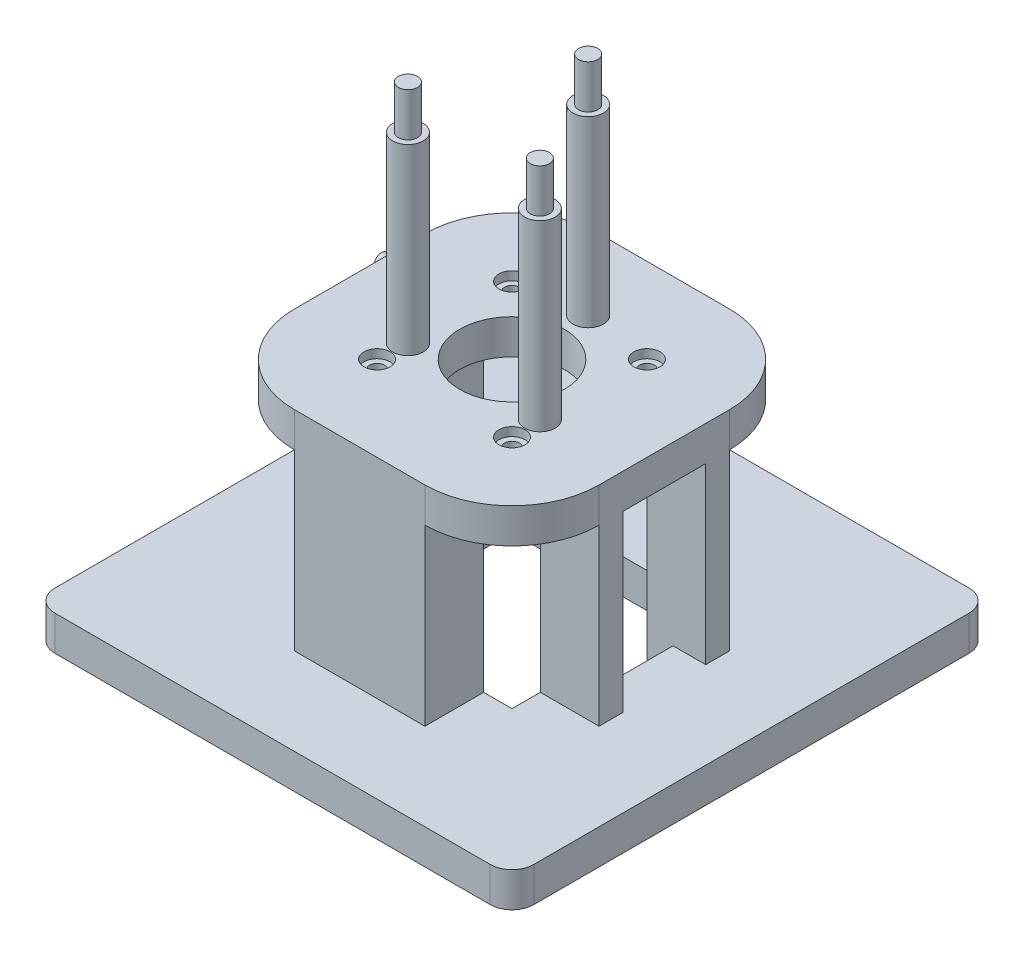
ISO-10303-21;
HEADER;
FILE_DESCRIPTION(('STEP AP214'),'2;1');
FILE_NAME('part.step','',(''),(''),'','','');
FILE_SCHEMA(('AUTOMOTIVE_DESIGN { 1 0 10303 214 1 1 1 1 }'));
ENDSEC;
DATA;
#1=APPLICATION_CONTEXT('core data for automotive mechanical design processes');
#2=APPLICATION_PROTOCOL_DEFINITION('international standard','automotive_design',2000,#1);
#3=PRODUCT_CONTEXT('',#1,'mechanical');
#4=PRODUCT('Part','Part','',(#3));
#5=PRODUCT_RELATED_PRODUCT_CATEGORY('part','',(#4));
#6=PRODUCT_DEFINITION_FORMATION('','',#4);
#7=PRODUCT_DEFINITION_CONTEXT('part definition',#1,'design');
#8=PRODUCT_DEFINITION('design','',#6,#7);
#9=PRODUCT_DEFINITION_SHAPE('','',#8);
#10=(LENGTH_UNIT() NAMED_UNIT(*) SI_UNIT(.MILLI.,.METRE.));
#11=(NAMED_UNIT(*) PLANE_ANGLE_UNIT() SI_UNIT($,.RADIAN.));
#12=(NAMED_UNIT(*) SI_UNIT($,.STERADIAN.) SOLID_ANGLE_UNIT());
#13=UNCERTAINTY_MEASURE_WITH_UNIT(LENGTH_MEASURE(1.E-05),#10,'distance_accuracy_value','');
#14=(GEOMETRIC_REPRESENTATION_CONTEXT(3) GLOBAL_UNCERTAINTY_ASSIGNED_CONTEXT((#13)) GLOBAL_UNIT_ASSIGNED_CONTEXT((#10,
#11,#12)) REPRESENTATION_CONTEXT('',''));
#15=CARTESIAN_POINT('',(0.,0.,0.));
#16=DIRECTION('',(0.,0.,1.));
#17=DIRECTION('',(1.,0.,0.));
#18=AXIS2_PLACEMENT_3D('',#15,#16,#17);
#19=CARTESIAN_POINT('',(21.5,-80.897568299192,-9.49999999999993));
#20=DIRECTION('',(1.,0.,0.));
#21=DIRECTION('',(0.,0.,-1.));
#22=AXIS2_PLACEMENT_3D('',#19,#20,#21);
#23=PLANE('',#22);
#24=DIRECTION('',(0.,0.,1.));
#25=VECTOR('',#24,1.);
#26=CARTESIAN_POINT('',(21.5,-56.,21.5));
#27=LINE('',#26,#25);
#28=CARTESIAN_POINT('',(21.5,-56.,-21.5));
#29=VERTEX_POINT('',#28);
#30=CARTESIAN_POINT('',(21.5,-56.,-9.49999999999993));
#31=VERTEX_POINT('',#30);
#32=EDGE_CURVE('E286',#29,#31,#27,.T.);
#33=ORIENTED_EDGE('',*,*,#32,.T.);
#34=DIRECTION('',(0.,1.,0.));
#35=VECTOR('',#34,1.);
#36=CARTESIAN_POINT('',(21.5,-80.897568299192,-9.49999999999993));
#37=LINE('',#36,#35);
#38=CARTESIAN_POINT('',(21.5,-8.,-9.49999999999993));
#39=VERTEX_POINT('',#38);
#40=EDGE_CURVE('E267',#31,#39,#37,.T.);
#41=ORIENTED_EDGE('',*,*,#40,.T.);
#42=DIRECTION('',(0.,0.,-1.));
#43=VECTOR('',#42,1.);
#44=CARTESIAN_POINT('',(21.5,-8.,-9.49999999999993));
#45=LINE('',#44,#43);
#46=CARTESIAN_POINT('',(21.5,-8.,-14.9999999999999));
#47=VERTEX_POINT('',#46);
#48=EDGE_CURVE('E278',#39,#47,#45,.T.);
#49=ORIENTED_EDGE('',*,*,#48,.T.);
#50=DIRECTION('',(0.,1.,0.));
#51=VECTOR('',#50,1.);
#52=CARTESIAN_POINT('',(21.5,-80.897568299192,-14.9999999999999));
#53=LINE('',#52,#51);
#54=CARTESIAN_POINT('',(21.5,-48.,-14.9999999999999));
#55=VERTEX_POINT('',#54);
#56=EDGE_CURVE('E402',#55,#47,#53,.T.);
#57=ORIENTED_EDGE('',*,*,#56,.F.);
#58=DIRECTION('',(0.,0.,1.));
#59=VECTOR('',#58,1.);
#60=CARTESIAN_POINT('',(21.5,-48.,21.5));
#61=LINE('',#60,#59);
#62=CARTESIAN_POINT('',(21.5,-48.,-21.5));
#63=VERTEX_POINT('',#62);
#64=EDGE_CURVE('E632',#63,#55,#61,.T.);
#65=ORIENTED_EDGE('',*,*,#64,.F.);
#66=DIRECTION('',(0.,-1.,0.));
#67=VECTOR('',#66,1.);
#68=CARTESIAN_POINT('',(21.5,-48.,-21.5));
#69=LINE('',#68,#67);
#70=EDGE_CURVE('E292',#63,#29,#69,.T.);
#71=ORIENTED_EDGE('',*,*,#70,.T.);
#72=EDGE_LOOP('',(#33,#41,#49,#57,#65,#71));
#73=FACE_BOUND('',#72,.T.);
#74=ADVANCED_FACE('F37',(#73),#23,.F.);
#75=CARTESIAN_POINT('',(0.,-8.,0.));
#76=DIRECTION('',(0.,1.,0.));
#77=DIRECTION('',(0.,0.,1.));
#78=AXIS2_PLACEMENT_3D('',#75,#76,#77);
#79=PLANE('',#78);
#80=CARTESIAN_POINT('',(-15.5,-8.00000000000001,-15.5));
#81=DIRECTION('',(0.,1.,0.));
#82=DIRECTION('',(0.,0.,1.));
#83=AXIS2_PLACEMENT_3D('',#80,#81,#82);
#84=CIRCLE('',#83,1.70000000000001);
#85=CARTESIAN_POINT('',(-15.5,-8.00000000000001,-13.8));
#86=VERTEX_POINT('',#85);
#87=EDGE_CURVE('E458',#86,#86,#84,.T.);
#88=ORIENTED_EDGE('',*,*,#87,.T.);
#89=EDGE_LOOP('',(#88));
#90=FACE_BOUND('',#89,.T.);
#91=CARTESIAN_POINT('',(15.5,-8.00000000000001,-15.5));
#92=DIRECTION('',(0.,1.,0.));
#93=DIRECTION('',(0.,0.,1.));
#94=AXIS2_PLACEMENT_3D('',#91,#92,#93);
#95=CIRCLE('',#94,1.70000000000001);
#96=CARTESIAN_POINT('',(15.5,-8.00000000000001,-13.8));
#97=VERTEX_POINT('',#96);
#98=EDGE_CURVE('E470',#97,#97,#95,.T.);
#99=ORIENTED_EDGE('',*,*,#98,.T.);
#100=EDGE_LOOP('',(#99));
#101=FACE_BOUND('',#100,.T.);
#102=CARTESIAN_POINT('',(15.5,-8.00000000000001,15.5));
#103=DIRECTION('',(0.,1.,0.));
#104=DIRECTION('',(0.,0.,1.));
#105=AXIS2_PLACEMENT_3D('',#102,#103,#104);
#106=CIRCLE('',#105,1.70000000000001);
#107=CARTESIAN_POINT('',(15.5,-8.00000000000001,17.2));
#108=VERTEX_POINT('',#107);
#109=EDGE_CURVE('E482',#108,#108,#106,.T.);
#110=ORIENTED_EDGE('',*,*,#109,.T.);
#111=EDGE_LOOP('',(#110));
#112=FACE_BOUND('',#111,.T.);
#113=CARTESIAN_POINT('',(-15.5,-8.00000000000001,15.5));
#114=DIRECTION('',(0.,1.,0.));
#115=DIRECTION('',(0.,0.,1.));
#116=AXIS2_PLACEMENT_3D('',#113,#114,#115);
#117=CIRCLE('',#116,1.70000000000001);
#118=CARTESIAN_POINT('',(-15.5,-8.00000000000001,17.2));
#119=VERTEX_POINT('',#118);
#120=EDGE_CURVE('E494',#119,#119,#117,.T.);
#121=ORIENTED_EDGE('',*,*,#120,.T.);
#122=EDGE_LOOP('',(#121));
#123=FACE_BOUND('',#122,.T.);
#124=CARTESIAN_POINT('',(0.,-8.,0.));
#125=DIRECTION('',(0.,1.,0.));
#126=DIRECTION('',(0.,0.,1.));
#127=AXIS2_PLACEMENT_3D('',#124,#125,#126);
#128=CIRCLE('',#127,12.);
#129=CARTESIAN_POINT('',(0.,-8.,12.));
#130=VERTEX_POINT('',#129);
#131=EDGE_CURVE('E498',#130,#130,#128,.T.);
#132=ORIENTED_EDGE('',*,*,#131,.T.);
#133=EDGE_LOOP('',(#132));
#134=FACE_BOUND('',#133,.T.);
#135=DIRECTION('',(0.,0.,-1.));
#136=VECTOR('',#135,1.);
#137=CARTESIAN_POINT('',(-14.9999999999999,-8.,35.));
#138=LINE('',#137,#136);
#139=CARTESIAN_POINT('',(-14.9999999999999,-8.,35.));
#140=VERTEX_POINT('',#139);
#141=CARTESIAN_POINT('',(-15.,-8.,21.5));
#142=VERTEX_POINT('',#141);
#143=EDGE_CURVE('E354',#140,#142,#138,.T.);
#144=ORIENTED_EDGE('',*,*,#143,.F.);
#145=CARTESIAN_POINT('',(-15.,-8.,15.));
#146=DIRECTION('',(0.,1.,0.));
#147=DIRECTION('',(0.,0.,1.));
#148=AXIS2_PLACEMENT_3D('',#145,#146,#147);
#149=CIRCLE('',#148,20.);
#150=CARTESIAN_POINT('',(-35.,-8.,14.9999999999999));
#151=VERTEX_POINT('',#150);
#152=EDGE_CURVE('E512',#151,#140,#149,.T.);
#153=ORIENTED_EDGE('',*,*,#152,.F.);
#154=DIRECTION('',(-1.,0.,0.));
#155=VECTOR('',#154,1.);
#156=CARTESIAN_POINT('',(-35.,-8.,14.9999999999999));
#157=LINE('',#156,#155);
#158=CARTESIAN_POINT('',(-21.5,-8.,15.));
#159=VERTEX_POINT('',#158);
#160=EDGE_CURVE('E424',#159,#151,#157,.T.);
#161=ORIENTED_EDGE('',*,*,#160,.F.);
#162=DIRECTION('',(0.,0.,1.));
#163=VECTOR('',#162,1.);
#164=CARTESIAN_POINT('',(-21.5,-8.,15.));
#165=LINE('',#164,#163);
#166=CARTESIAN_POINT('',(-21.5,-8.,-15.));
#167=VERTEX_POINT('',#166);
#168=EDGE_CURVE('E433',#167,#159,#165,.T.);
#169=ORIENTED_EDGE('',*,*,#168,.F.);
#170=DIRECTION('',(1.,0.,0.));
#171=VECTOR('',#170,1.);
#172=CARTESIAN_POINT('',(-35.,-8.,-14.9999999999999));
#173=LINE('',#172,#171);
#174=CARTESIAN_POINT('',(-35.,-8.,-14.9999999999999));
#175=VERTEX_POINT('',#174);
#176=EDGE_CURVE('E409',#175,#167,#173,.T.);
#177=ORIENTED_EDGE('',*,*,#176,.F.);
#178=CARTESIAN_POINT('',(-15.,-8.,-15.));
#179=DIRECTION('',(0.,1.,0.));
#180=DIRECTION('',(0.,0.,1.));
#181=AXIS2_PLACEMENT_3D('',#178,#179,#180);
#182=CIRCLE('',#181,20.);
#183=CARTESIAN_POINT('',(-14.9999999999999,-8.,-35.));
#184=VERTEX_POINT('',#183);
#185=EDGE_CURVE('E509',#184,#175,#182,.T.);
#186=ORIENTED_EDGE('',*,*,#185,.F.);
#187=DIRECTION('',(1.,0.,0.));
#188=VECTOR('',#187,1.);
#189=CARTESIAN_POINT('',(0.,-8.,-35.));
#190=LINE('',#189,#188);
#191=CARTESIAN_POINT('',(14.9999999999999,-8.,-35.));
#192=VERTEX_POINT('',#191);
#193=EDGE_CURVE('E506',#184,#192,#190,.T.);
#194=ORIENTED_EDGE('',*,*,#193,.T.);
#195=CARTESIAN_POINT('',(15.,-8.,-15.));
#196=DIRECTION('',(0.,1.,0.));
#197=DIRECTION('',(0.,0.,1.));
#198=AXIS2_PLACEMENT_3D('',#195,#196,#197);
#199=CIRCLE('',#198,20.);
#200=CARTESIAN_POINT('',(35.,-8.,-14.9999999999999));
#201=VERTEX_POINT('',#200);
#202=EDGE_CURVE('E504',#192,#201,#199,.F.);
#203=ORIENTED_EDGE('',*,*,#202,.T.);
#204=DIRECTION('',(1.,0.,0.));
#205=VECTOR('',#204,1.);
#206=CARTESIAN_POINT('',(35.,-8.,-14.9999999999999));
#207=LINE('',#206,#205);
#208=EDGE_CURVE('E398',#47,#201,#207,.T.);
#209=ORIENTED_EDGE('',*,*,#208,.F.);
#210=ORIENTED_EDGE('',*,*,#48,.F.);
#211=DIRECTION('',(-1.,0.,0.));
#212=VECTOR('',#211,1.);
#213=CARTESIAN_POINT('',(35.,-8.,-9.49999999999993));
#214=LINE('',#213,#212);
#215=CARTESIAN_POINT('',(35.,-8.,-9.49999999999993));
#216=VERTEX_POINT('',#215);
#217=EDGE_CURVE('E274',#216,#39,#214,.T.);
#218=ORIENTED_EDGE('',*,*,#217,.F.);
#219=DIRECTION('',(0.,0.,1.));
#220=VECTOR('',#219,1.);
#221=CARTESIAN_POINT('',(35.,-8.,0.));
#222=LINE('',#221,#220);
#223=CARTESIAN_POINT('',(35.,-8.,9.50000000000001));
#224=VERTEX_POINT('',#223);
#225=EDGE_CURVE('E518',#216,#224,#222,.T.);
#226=ORIENTED_EDGE('',*,*,#225,.T.);
#227=DIRECTION('',(1.,0.,0.));
#228=VECTOR('',#227,1.);
#229=CARTESIAN_POINT('',(35.,-8.,9.50000000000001));
#230=LINE('',#229,#228);
#231=CARTESIAN_POINT('',(21.5,-8.,9.50000000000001));
#232=VERTEX_POINT('',#231);
#233=EDGE_CURVE('E378',#232,#224,#230,.T.);
#234=ORIENTED_EDGE('',*,*,#233,.F.);
#235=DIRECTION('',(0.,0.,-1.));
#236=VECTOR('',#235,1.);
#237=CARTESIAN_POINT('',(21.5,-8.,14.9999999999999));
#238=LINE('',#237,#236);
#239=CARTESIAN_POINT('',(21.5,-8.,14.9999999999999));
#240=VERTEX_POINT('',#239);
#241=EDGE_CURVE('E377',#240,#232,#238,.T.);
#242=ORIENTED_EDGE('',*,*,#241,.F.);
#243=DIRECTION('',(-1.,0.,0.));
#244=VECTOR('',#243,1.);
#245=CARTESIAN_POINT('',(35.,-8.,14.9999999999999));
#246=LINE('',#245,#244);
#247=CARTESIAN_POINT('',(35.,-8.,14.9999999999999));
#248=VERTEX_POINT('',#247);
#249=EDGE_CURVE('E382',#248,#240,#246,.T.);
#250=ORIENTED_EDGE('',*,*,#249,.F.);
#251=CARTESIAN_POINT('',(15.,-8.,15.));
#252=DIRECTION('',(0.,1.,0.));
#253=DIRECTION('',(0.,0.,1.));
#254=AXIS2_PLACEMENT_3D('',#251,#252,#253);
#255=CIRCLE('',#254,20.);
#256=CARTESIAN_POINT('',(14.9999999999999,-8.,35.));
#257=VERTEX_POINT('',#256);
#258=EDGE_CURVE('E515',#248,#257,#255,.F.);
#259=ORIENTED_EDGE('',*,*,#258,.T.);
#260=DIRECTION('',(0.,0.,1.));
#261=VECTOR('',#260,1.);
#262=CARTESIAN_POINT('',(14.9999999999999,-8.,35.));
#263=LINE('',#262,#261);
#264=CARTESIAN_POINT('',(15.,-8.,21.5));
#265=VERTEX_POINT('',#264);
#266=EDGE_CURVE('E351',#265,#257,#263,.T.);
#267=ORIENTED_EDGE('',*,*,#266,.F.);
#268=DIRECTION('',(1.,0.,0.));
#269=VECTOR('',#268,1.);
#270=CARTESIAN_POINT('',(15.,-8.,21.5));
#271=LINE('',#270,#269);
#272=EDGE_CURVE('E350',#142,#265,#271,.T.);
#273=ORIENTED_EDGE('',*,*,#272,.F.);
#274=EDGE_LOOP('',(#144,#153,#161,#169,#177,#186,#194,#203,#209,#210,#218,#226,#234,#242,#250,
#259,#267,#273));
#275=FACE_BOUND('',#274,.T.);
#276=ADVANCED_FACE('F652',(#90,#101,#112,#123,#134,#275),#79,.F.);
#277=CARTESIAN_POINT('',(15.,-8.,-15.));
#278=DIRECTION('',(0.,1.,0.));
#279=DIRECTION('',(0.,0.,1.));
#280=AXIS2_PLACEMENT_3D('',#277,#278,#279);
#281=CYLINDRICAL_SURFACE('',#280,20.);
#282=CARTESIAN_POINT('',(15.,0.,-15.));
#283=DIRECTION('',(0.,1.,0.));
#284=DIRECTION('',(0.,0.,1.));
#285=AXIS2_PLACEMENT_3D('',#282,#283,#284);
#286=CIRCLE('',#285,20.);
#287=CARTESIAN_POINT('',(14.9999999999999,0.,-35.));
#288=VERTEX_POINT('',#287);
#289=CARTESIAN_POINT('',(35.,0.,-14.9999999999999));
#290=VERTEX_POINT('',#289);
#291=EDGE_CURVE('E501',#288,#290,#286,.F.);
#292=ORIENTED_EDGE('',*,*,#291,.T.);
#293=DIRECTION('',(0.,1.,0.));
#294=VECTOR('',#293,1.);
#295=CARTESIAN_POINT('',(35.,-8.,-14.9999999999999));
#296=LINE('',#295,#294);
#297=EDGE_CURVE('E541',#201,#290,#296,.T.);
#298=ORIENTED_EDGE('',*,*,#297,.F.);
#299=ORIENTED_EDGE('',*,*,#202,.F.);
#300=DIRECTION('',(0.,1.,0.));
#301=VECTOR('',#300,1.);
#302=CARTESIAN_POINT('',(14.9999999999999,-8.,-35.));
#303=LINE('',#302,#301);
#304=EDGE_CURVE('E520',#192,#288,#303,.T.);
#305=ORIENTED_EDGE('',*,*,#304,.T.);
#306=EDGE_LOOP('',(#292,#298,#299,#305));
#307=FACE_BOUND('',#306,.T.);
#308=ADVANCED_FACE('F667',(#307),#281,.T.);
#309=CARTESIAN_POINT('',(35.,-8.,0.));
#310=DIRECTION('',(-1.,0.,0.));
#311=DIRECTION('',(0.,0.,1.));
#312=AXIS2_PLACEMENT_3D('',#309,#310,#311);
#313=PLANE('',#312);
#314=DIRECTION('',(0.,0.,1.));
#315=VECTOR('',#314,1.);
#316=CARTESIAN_POINT('',(35.,0.,0.));
#317=LINE('',#316,#315);
#318=CARTESIAN_POINT('',(35.,0.,14.9999999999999));
#319=VERTEX_POINT('',#318);
#320=EDGE_CURVE('E507',#290,#319,#317,.T.);
#321=ORIENTED_EDGE('',*,*,#320,.T.);
#322=DIRECTION('',(0.,1.,0.));
#323=VECTOR('',#322,1.);
#324=CARTESIAN_POINT('',(35.,-8.,14.9999999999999));
#325=LINE('',#324,#323);
#326=EDGE_CURVE('E545',#248,#319,#325,.T.);
#327=ORIENTED_EDGE('',*,*,#326,.F.);
#328=DIRECTION('',(0.,1.,0.));
#329=VECTOR('',#328,1.);
#330=CARTESIAN_POINT('',(35.,-80.897568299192,14.9999999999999));
#331=LINE('',#330,#329);
#332=CARTESIAN_POINT('',(35.,-48.,14.9999999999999));
#333=VERTEX_POINT('',#332);
#334=EDGE_CURVE('E373',#333,#248,#331,.T.);
#335=ORIENTED_EDGE('',*,*,#334,.F.);
#336=DIRECTION('',(0.,0.,1.));
#337=VECTOR('',#336,1.);
#338=CARTESIAN_POINT('',(35.,-48.,9.50000000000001));
#339=LINE('',#338,#337);
#340=CARTESIAN_POINT('',(35.,-48.,9.50000000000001));
#341=VERTEX_POINT('',#340);
#342=EDGE_CURVE('E387',#341,#333,#339,.T.);
#343=ORIENTED_EDGE('',*,*,#342,.F.);
#344=DIRECTION('',(0.,1.,0.));
#345=VECTOR('',#344,1.);
#346=CARTESIAN_POINT('',(35.,-80.897568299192,9.50000000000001));
#347=LINE('',#346,#345);
#348=EDGE_CURVE('E369',#341,#224,#347,.T.);
#349=ORIENTED_EDGE('',*,*,#348,.T.);
#350=ORIENTED_EDGE('',*,*,#225,.F.);
#351=DIRECTION('',(0.,1.,0.));
#352=VECTOR('',#351,1.);
#353=CARTESIAN_POINT('',(35.,-80.897568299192,-9.49999999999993));
#354=LINE('',#353,#352);
#355=CARTESIAN_POINT('',(35.,-48.,-9.49999999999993));
#356=VERTEX_POINT('',#355);
#357=EDGE_CURVE('E405',#356,#216,#354,.T.);
#358=ORIENTED_EDGE('',*,*,#357,.F.);
#359=DIRECTION('',(0.,0.,1.));
#360=VECTOR('',#359,1.);
#361=CARTESIAN_POINT('',(35.,-48.,-14.9999999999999));
#362=LINE('',#361,#360);
#363=CARTESIAN_POINT('',(35.,-48.,-14.9999999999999));
#364=VERTEX_POINT('',#363);
#365=EDGE_CURVE('E410',#364,#356,#362,.T.);
#366=ORIENTED_EDGE('',*,*,#365,.F.);
#367=DIRECTION('',(0.,1.,0.));
#368=VECTOR('',#367,1.);
#369=CARTESIAN_POINT('',(35.,-80.897568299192,-14.9999999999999));
#370=LINE('',#369,#368);
#371=EDGE_CURVE('E372',#364,#201,#370,.T.);
#372=ORIENTED_EDGE('',*,*,#371,.T.);
#373=ORIENTED_EDGE('',*,*,#297,.T.);
#374=EDGE_LOOP('',(#321,#327,#335,#343,#349,#350,#358,#366,#372,#373));
#375=FACE_BOUND('',#374,.T.);
#376=ADVANCED_FACE('F671',(#375),#313,.F.);
#377=CARTESIAN_POINT('',(15.,-8.,15.));
#378=DIRECTION('',(0.,1.,0.));
#379=DIRECTION('',(0.,0.,1.));
#380=AXIS2_PLACEMENT_3D('',#377,#378,#379);
#381=CYLINDRICAL_SURFACE('',#380,20.);
#382=CARTESIAN_POINT('',(15.,0.,15.));
#383=DIRECTION('',(0.,1.,0.));
#384=DIRECTION('',(0.,0.,1.));
#385=AXIS2_PLACEMENT_3D('',#382,#383,#384);
#386=CIRCLE('',#385,20.);
#387=CARTESIAN_POINT('',(14.9999999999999,0.,35.));
#388=VERTEX_POINT('',#387);
#389=EDGE_CURVE('E537',#319,#388,#386,.F.);
#390=ORIENTED_EDGE('',*,*,#389,.T.);
#391=DIRECTION('',(0.,1.,0.));
#392=VECTOR('',#391,1.);
#393=CARTESIAN_POINT('',(14.9999999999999,-8.,35.));
#394=LINE('',#393,#392);
#395=EDGE_CURVE('E548',#257,#388,#394,.T.);
#396=ORIENTED_EDGE('',*,*,#395,.F.);
#397=ORIENTED_EDGE('',*,*,#258,.F.);
#398=ORIENTED_EDGE('',*,*,#326,.T.);
#399=EDGE_LOOP('',(#390,#396,#397,#398));
#400=FACE_BOUND('',#399,.T.);
#401=ADVANCED_FACE('F809',(#400),#381,.T.);
#402=CARTESIAN_POINT('',(0.,-8.,35.));
#403=DIRECTION('',(0.,0.,1.));
#404=DIRECTION('',(1.,0.,0.));
#405=AXIS2_PLACEMENT_3D('',#402,#403,#404);
#406=PLANE('',#405);
#407=DIRECTION('',(1.,0.,0.));
#408=VECTOR('',#407,1.);
#409=CARTESIAN_POINT('',(0.,0.,35.));
#410=LINE('',#409,#408);
#411=CARTESIAN_POINT('',(-14.9999999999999,0.,35.));
#412=VERTEX_POINT('',#411);
#413=EDGE_CURVE('E534',#412,#388,#410,.T.);
#414=ORIENTED_EDGE('',*,*,#413,.F.);
#415=DIRECTION('',(0.,1.,0.));
#416=VECTOR('',#415,1.);
#417=CARTESIAN_POINT('',(-14.9999999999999,-8.,35.));
#418=LINE('',#417,#416);
#419=EDGE_CURVE('E550',#140,#412,#418,.T.);
#420=ORIENTED_EDGE('',*,*,#419,.F.);
#421=DIRECTION('',(0.,1.,0.));
#422=VECTOR('',#421,1.);
#423=CARTESIAN_POINT('',(-14.9999999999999,-80.897568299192,35.));
#424=LINE('',#423,#422);
#425=CARTESIAN_POINT('',(-14.9999999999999,-48.,35.));
#426=VERTEX_POINT('',#425);
#427=EDGE_CURVE('E347',#426,#140,#424,.T.);
#428=ORIENTED_EDGE('',*,*,#427,.F.);
#429=DIRECTION('',(-1.,0.,0.));
#430=VECTOR('',#429,1.);
#431=CARTESIAN_POINT('',(-14.9999999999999,-48.,35.));
#432=LINE('',#431,#430);
#433=CARTESIAN_POINT('',(14.9999999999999,-48.,35.));
#434=VERTEX_POINT('',#433);
#435=EDGE_CURVE('E359',#434,#426,#432,.T.);
#436=ORIENTED_EDGE('',*,*,#435,.F.);
#437=DIRECTION('',(0.,1.,0.));
#438=VECTOR('',#437,1.);
#439=CARTESIAN_POINT('',(14.9999999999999,-80.897568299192,35.));
#440=LINE('',#439,#438);
#441=EDGE_CURVE('E343',#434,#257,#440,.T.);
#442=ORIENTED_EDGE('',*,*,#441,.T.);
#443=ORIENTED_EDGE('',*,*,#395,.T.);
#444=EDGE_LOOP('',(#414,#420,#428,#436,#442,#443));
#445=FACE_BOUND('',#444,.T.);
#446=ADVANCED_FACE('F705',(#445),#406,.T.);
#447=CARTESIAN_POINT('',(-15.,-8.,15.));
#448=DIRECTION('',(0.,1.,0.));
#449=DIRECTION('',(0.,0.,1.));
#450=AXIS2_PLACEMENT_3D('',#447,#448,#449);
#451=CYLINDRICAL_SURFACE('',#450,20.);
#452=CARTESIAN_POINT('',(-15.,0.,15.));
#453=DIRECTION('',(0.,1.,0.));
#454=DIRECTION('',(0.,0.,1.));
#455=AXIS2_PLACEMENT_3D('',#452,#453,#454);
#456=CIRCLE('',#455,20.);
#457=CARTESIAN_POINT('',(-35.,0.,14.9999999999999));
#458=VERTEX_POINT('',#457);
#459=EDGE_CURVE('E531',#458,#412,#456,.T.);
#460=ORIENTED_EDGE('',*,*,#459,.F.);
#461=DIRECTION('',(0.,1.,0.));
#462=VECTOR('',#461,1.);
#463=CARTESIAN_POINT('',(-35.,-8.,14.9999999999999));
#464=LINE('',#463,#462);
#465=EDGE_CURVE('E552',#151,#458,#464,.T.);
#466=ORIENTED_EDGE('',*,*,#465,.F.);
#467=ORIENTED_EDGE('',*,*,#152,.T.);
#468=ORIENTED_EDGE('',*,*,#419,.T.);
#469=EDGE_LOOP('',(#460,#466,#467,#468));
#470=FACE_BOUND('',#469,.T.);
#471=ADVANCED_FACE('F815',(#470),#451,.T.);
#472=CARTESIAN_POINT('',(-35.,-8.,0.));
#473=DIRECTION('',(-1.,0.,0.));
#474=DIRECTION('',(0.,0.,1.));
#475=AXIS2_PLACEMENT_3D('',#472,#473,#474);
#476=PLANE('',#475);
#477=CARTESIAN_POINT('',(-35.,-41.4568978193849,-9.99999999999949));
#478=DIRECTION('',(-1.,0.,0.));
#479=DIRECTION('',(0.,0.,1.));
#480=AXIS2_PLACEMENT_3D('',#477,#478,#479);
#481=CIRCLE('',#480,1.7);
#482=CARTESIAN_POINT('',(-35.,-41.4568978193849,-8.29999999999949));
#483=VERTEX_POINT('',#482);
#484=EDGE_CURVE('E1480',#483,#483,#481,.T.);
#485=ORIENTED_EDGE('',*,*,#484,.F.);
#486=EDGE_LOOP('',(#485));
#487=FACE_BOUND('',#486,.T.);
#488=CARTESIAN_POINT('',(-35.,-5.45689781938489,-9.99999999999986));
#489=DIRECTION('',(-1.,0.,0.));
#490=DIRECTION('',(0.,0.,1.));
#491=AXIS2_PLACEMENT_3D('',#488,#489,#490);
#492=CIRCLE('',#491,1.7);
#493=CARTESIAN_POINT('',(-35.,-5.45689781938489,-8.29999999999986));
#494=VERTEX_POINT('',#493);
#495=EDGE_CURVE('E1483',#494,#494,#492,.T.);
#496=ORIENTED_EDGE('',*,*,#495,.F.);
#497=EDGE_LOOP('',(#496));
#498=FACE_BOUND('',#497,.T.);
#499=DIRECTION('',(0.,0.,1.));
#500=VECTOR('',#499,1.);
#501=CARTESIAN_POINT('',(-35.,0.,0.));
#502=LINE('',#501,#500);
#503=CARTESIAN_POINT('',(-35.,0.,-14.9999999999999));
#504=VERTEX_POINT('',#503);
#505=EDGE_CURVE('E528',#504,#458,#502,.T.);
#506=ORIENTED_EDGE('',*,*,#505,.F.);
#507=DIRECTION('',(0.,1.,0.));
#508=VECTOR('',#507,1.);
#509=CARTESIAN_POINT('',(-35.,-8.,-14.9999999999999));
#510=LINE('',#509,#508);
#511=EDGE_CURVE('E554',#175,#504,#510,.T.);
#512=ORIENTED_EDGE('',*,*,#511,.F.);
#513=DIRECTION('',(0.,1.,0.));
#514=VECTOR('',#513,1.);
#515=CARTESIAN_POINT('',(-35.,-48.,-14.9999999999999));
#516=LINE('',#515,#514);
#517=CARTESIAN_POINT('',(-35.,-48.,-14.9999999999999));
#518=VERTEX_POINT('',#517);
#519=EDGE_CURVE('E446',#518,#175,#516,.T.);
#520=ORIENTED_EDGE('',*,*,#519,.F.);
#521=DIRECTION('',(0.,0.,-1.));
#522=VECTOR('',#521,1.);
#523=CARTESIAN_POINT('',(-35.,-48.,14.9999999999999));
#524=LINE('',#523,#522);
#525=CARTESIAN_POINT('',(-35.,-48.,14.9999999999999));
#526=VERTEX_POINT('',#525);
#527=EDGE_CURVE('E420',#526,#518,#524,.T.);
#528=ORIENTED_EDGE('',*,*,#527,.F.);
#529=DIRECTION('',(0.,1.,0.));
#530=VECTOR('',#529,1.);
#531=CARTESIAN_POINT('',(-35.,-48.,14.9999999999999));
#532=LINE('',#531,#530);
#533=EDGE_CURVE('E430',#526,#151,#532,.T.);
#534=ORIENTED_EDGE('',*,*,#533,.T.);
#535=ORIENTED_EDGE('',*,*,#465,.T.);
#536=EDGE_LOOP('',(#506,#512,#520,#528,#534,#535));
#537=FACE_BOUND('',#536,.T.);
#538=ADVANCED_FACE('F655',(#487,#498,#537),#476,.T.);
#539=CARTESIAN_POINT('',(-15.,-8.,-15.));
#540=DIRECTION('',(0.,1.,0.));
#541=DIRECTION('',(0.,0.,1.));
#542=AXIS2_PLACEMENT_3D('',#539,#540,#541);
#543=CYLINDRICAL_SURFACE('',#542,20.);
#544=CARTESIAN_POINT('',(-15.,0.,-15.));
#545=DIRECTION('',(0.,1.,0.));
#546=DIRECTION('',(0.,0.,1.));
#547=AXIS2_PLACEMENT_3D('',#544,#545,#546);
#548=CIRCLE('',#547,20.);
#549=CARTESIAN_POINT('',(-14.9999999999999,0.,-35.));
#550=VERTEX_POINT('',#549);
#551=EDGE_CURVE('E525',#550,#504,#548,.T.);
#552=ORIENTED_EDGE('',*,*,#551,.F.);
#553=DIRECTION('',(0.,1.,0.));
#554=VECTOR('',#553,1.);
#555=CARTESIAN_POINT('',(-14.9999999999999,-8.,-35.));
#556=LINE('',#555,#554);
#557=EDGE_CURVE('E556',#184,#550,#556,.T.);
#558=ORIENTED_EDGE('',*,*,#557,.F.);
#559=ORIENTED_EDGE('',*,*,#185,.T.);
#560=ORIENTED_EDGE('',*,*,#511,.T.);
#561=EDGE_LOOP('',(#552,#558,#559,#560));
#562=FACE_BOUND('',#561,.T.);
#563=ADVANCED_FACE('F658',(#562),#543,.T.);
#564=CARTESIAN_POINT('',(0.,-8.,-35.));
#565=DIRECTION('',(0.,0.,1.));
#566=DIRECTION('',(1.,0.,0.));
#567=AXIS2_PLACEMENT_3D('',#564,#565,#566);
#568=PLANE('',#567);
#569=DIRECTION('',(1.,0.,0.));
#570=VECTOR('',#569,1.);
#571=CARTESIAN_POINT('',(0.,0.,-35.));
#572=LINE('',#571,#570);
#573=EDGE_CURVE('E523',#550,#288,#572,.T.);
#574=ORIENTED_EDGE('',*,*,#573,.T.);
#575=ORIENTED_EDGE('',*,*,#304,.F.);
#576=ORIENTED_EDGE('',*,*,#193,.F.);
#577=ORIENTED_EDGE('',*,*,#557,.T.);
#578=EDGE_LOOP('',(#574,#575,#576,#577));
#579=FACE_BOUND('',#578,.T.);
#580=ADVANCED_FACE('F663',(#579),#568,.F.);
#581=CARTESIAN_POINT('',(0.,0.,0.));
#582=DIRECTION('',(0.,1.,0.));
#583=DIRECTION('',(0.,0.,1.));
#584=AXIS2_PLACEMENT_3D('',#581,#582,#583);
#585=PLANE('',#584);
#586=CARTESIAN_POINT('',(-15.1554445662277,0.,8.75000000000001));
#587=DIRECTION('',(0.,1.,0.));
#588=DIRECTION('',(0.,0.,1.));
#589=AXIS2_PLACEMENT_3D('',#586,#587,#588);
#590=CIRCLE('',#589,3.50000000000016);
#591=CARTESIAN_POINT('',(-15.1554445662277,0.,5.24999999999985));
#592=VERTEX_POINT('',#591);
#593=EDGE_CURVE('E607',#592,#592,#590,.T.);
#594=ORIENTED_EDGE('',*,*,#593,.F.);
#595=EDGE_LOOP('',(#594));
#596=FACE_BOUND('',#595,.T.);
#597=CARTESIAN_POINT('',(15.1554445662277,0.,8.75));
#598=DIRECTION('',(0.,1.,0.));
#599=DIRECTION('',(0.,0.,1.));
#600=AXIS2_PLACEMENT_3D('',#597,#598,#599);
#601=CIRCLE('',#600,3.50000000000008);
#602=CARTESIAN_POINT('',(15.1554445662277,0.,5.24999999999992));
#603=VERTEX_POINT('',#602);
#604=EDGE_CURVE('E614',#603,#603,#601,.T.);
#605=ORIENTED_EDGE('',*,*,#604,.F.);
#606=EDGE_LOOP('',(#605));
#607=FACE_BOUND('',#606,.T.);
#608=CARTESIAN_POINT('',(0.,0.,-17.5));
#609=DIRECTION('',(0.,1.,0.));
#610=DIRECTION('',(0.,0.,1.));
#611=AXIS2_PLACEMENT_3D('',#608,#609,#610);
#612=CIRCLE('',#611,3.5);
#613=CARTESIAN_POINT('',(0.,0.,-21.));
#614=VERTEX_POINT('',#613);
#615=EDGE_CURVE('E617',#614,#614,#612,.T.);
#616=ORIENTED_EDGE('',*,*,#615,.F.);
#617=EDGE_LOOP('',(#616));
#618=FACE_BOUND('',#617,.T.);
#619=CARTESIAN_POINT('',(-15.5,0.,-15.5));
#620=DIRECTION('',(0.,1.,0.));
#621=DIRECTION('',(0.,0.,1.));
#622=AXIS2_PLACEMENT_3D('',#619,#620,#621);
#623=CIRCLE('',#622,3.);
#624=CARTESIAN_POINT('',(-15.5,0.,-12.5));
#625=VERTEX_POINT('',#624);
#626=EDGE_CURVE('E449',#625,#625,#623,.T.);
#627=ORIENTED_EDGE('',*,*,#626,.F.);
#628=EDGE_LOOP('',(#627));
#629=FACE_BOUND('',#628,.T.);
#630=CARTESIAN_POINT('',(15.5,0.,-15.5));
#631=DIRECTION('',(0.,1.,0.));
#632=DIRECTION('',(0.,0.,1.));
#633=AXIS2_PLACEMENT_3D('',#630,#631,#632);
#634=CIRCLE('',#633,3.);
#635=CARTESIAN_POINT('',(15.5,0.,-12.5));
#636=VERTEX_POINT('',#635);
#637=EDGE_CURVE('E461',#636,#636,#634,.T.);
#638=ORIENTED_EDGE('',*,*,#637,.F.);
#639=EDGE_LOOP('',(#638));
#640=FACE_BOUND('',#639,.T.);
#641=CARTESIAN_POINT('',(15.5,0.,15.5));
#642=DIRECTION('',(0.,1.,0.));
#643=DIRECTION('',(0.,0.,1.));
#644=AXIS2_PLACEMENT_3D('',#641,#642,#643);
#645=CIRCLE('',#644,2.99999999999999);
#646=CARTESIAN_POINT('',(15.5,0.,18.5));
#647=VERTEX_POINT('',#646);
#648=EDGE_CURVE('E473',#647,#647,#645,.T.);
#649=ORIENTED_EDGE('',*,*,#648,.F.);
#650=EDGE_LOOP('',(#649));
#651=FACE_BOUND('',#650,.T.);
#652=CARTESIAN_POINT('',(-15.5,0.,15.5));
#653=DIRECTION('',(0.,1.,0.));
#654=DIRECTION('',(0.,0.,1.));
#655=AXIS2_PLACEMENT_3D('',#652,#653,#654);
#656=CIRCLE('',#655,3.);
#657=CARTESIAN_POINT('',(-15.5,0.,18.5));
#658=VERTEX_POINT('',#657);
#659=EDGE_CURVE('E485',#658,#658,#656,.T.);
#660=ORIENTED_EDGE('',*,*,#659,.F.);
#661=EDGE_LOOP('',(#660));
#662=FACE_BOUND('',#661,.T.);
#663=CARTESIAN_POINT('',(0.,0.,0.));
#664=DIRECTION('',(0.,1.,0.));
#665=DIRECTION('',(0.,0.,1.));
#666=AXIS2_PLACEMENT_3D('',#663,#664,#665);
#667=CIRCLE('',#666,12.);
#668=CARTESIAN_POINT('',(0.,0.,12.));
#669=VERTEX_POINT('',#668);
#670=EDGE_CURVE('E497',#669,#669,#667,.T.);
#671=ORIENTED_EDGE('',*,*,#670,.F.);
#672=EDGE_LOOP('',(#671));
#673=FACE_BOUND('',#672,.T.);
#674=ORIENTED_EDGE('',*,*,#291,.F.);
#675=ORIENTED_EDGE('',*,*,#573,.F.);
#676=ORIENTED_EDGE('',*,*,#551,.T.);
#677=ORIENTED_EDGE('',*,*,#505,.T.);
#678=ORIENTED_EDGE('',*,*,#459,.T.);
#679=ORIENTED_EDGE('',*,*,#413,.T.);
#680=ORIENTED_EDGE('',*,*,#389,.F.);
#681=ORIENTED_EDGE('',*,*,#320,.F.);
#682=EDGE_LOOP('',(#674,#675,#676,#677,#678,#679,#680,#681));
#683=FACE_BOUND('',#682,.T.);
#684=ADVANCED_FACE('F801',(#596,#607,#618,#629,#640,#651,#662,#673,#683),#585,.T.);
#685=CARTESIAN_POINT('',(0.,-8.,0.));
#686=DIRECTION('',(0.,1.,0.));
#687=DIRECTION('',(0.,0.,1.));
#688=AXIS2_PLACEMENT_3D('',#685,#686,#687);
#689=CYLINDRICAL_SURFACE('',#688,12.);
#690=ORIENTED_EDGE('',*,*,#131,.F.);
#691=EDGE_LOOP('',(#690));
#692=FACE_BOUND('',#691,.T.);
#693=ORIENTED_EDGE('',*,*,#670,.T.);
#694=EDGE_LOOP('',(#693));
#695=FACE_BOUND('',#694,.T.);
#696=ADVANCED_FACE('F798',(#692,#695),#689,.F.);
#697=CARTESIAN_POINT('',(-15.5,0.,15.5));
#698=DIRECTION('',(0.,1.,0.));
#699=DIRECTION('',(0.,0.,1.));
#700=AXIS2_PLACEMENT_3D('',#697,#698,#699);
#701=CYLINDRICAL_SURFACE('',#700,1.7);
#702=ORIENTED_EDGE('',*,*,#120,.F.);
#703=EDGE_LOOP('',(#702));
#704=FACE_BOUND('',#703,.T.);
#705=CARTESIAN_POINT('',(-15.5,-2.,15.5));
#706=DIRECTION('',(0.,1.,0.));
#707=DIRECTION('',(0.,0.,1.));
#708=AXIS2_PLACEMENT_3D('',#705,#706,#707);
#709=CIRCLE('',#708,1.7);
#710=CARTESIAN_POINT('',(-15.5,-2.,17.2));
#711=VERTEX_POINT('',#710);
#712=EDGE_CURVE('E491',#711,#711,#709,.T.);
#713=ORIENTED_EDGE('',*,*,#712,.T.);
#714=EDGE_LOOP('',(#713));
#715=FACE_BOUND('',#714,.T.);
#716=ADVANCED_FACE('F794',(#704,#715),#701,.F.);
#717=CARTESIAN_POINT('',(-13.8,-2.,15.5));
#718=DIRECTION('',(0.,-1.,0.));
#719=DIRECTION('',(0.,0.,-1.));
#720=AXIS2_PLACEMENT_3D('',#717,#718,#719);
#721=PLANE('',#720);
#722=ORIENTED_EDGE('',*,*,#712,.F.);
#723=EDGE_LOOP('',(#722));
#724=FACE_BOUND('',#723,.T.);
#725=CARTESIAN_POINT('',(-15.5,-2.,15.5));
#726=DIRECTION('',(0.,1.,0.));
#727=DIRECTION('',(0.,0.,1.));
#728=AXIS2_PLACEMENT_3D('',#725,#726,#727);
#729=CIRCLE('',#728,3.);
#730=CARTESIAN_POINT('',(-15.5,-2.,18.5));
#731=VERTEX_POINT('',#730);
#732=EDGE_CURVE('E488',#731,#731,#729,.T.);
#733=ORIENTED_EDGE('',*,*,#732,.T.);
#734=EDGE_LOOP('',(#733));
#735=FACE_BOUND('',#734,.T.);
#736=ADVANCED_FACE('F790',(#724,#735),#721,.F.);
#737=CARTESIAN_POINT('',(-15.5,0.,15.5));
#738=DIRECTION('',(0.,1.,0.));
#739=DIRECTION('',(0.,0.,1.));
#740=AXIS2_PLACEMENT_3D('',#737,#738,#739);
#741=CYLINDRICAL_SURFACE('',#740,3.);
#742=ORIENTED_EDGE('',*,*,#732,.F.);
#743=EDGE_LOOP('',(#742));
#744=FACE_BOUND('',#743,.T.);
#745=ORIENTED_EDGE('',*,*,#659,.T.);
#746=EDGE_LOOP('',(#745));
#747=FACE_BOUND('',#746,.T.);
#748=ADVANCED_FACE('F786',(#744,#747),#741,.F.);
#749=CARTESIAN_POINT('',(15.5,0.,15.5));
#750=DIRECTION('',(0.,1.,0.));
#751=DIRECTION('',(0.,0.,1.));
#752=AXIS2_PLACEMENT_3D('',#749,#750,#751);
#753=CYLINDRICAL_SURFACE('',#752,1.7);
#754=ORIENTED_EDGE('',*,*,#109,.F.);
#755=EDGE_LOOP('',(#754));
#756=FACE_BOUND('',#755,.T.);
#757=CARTESIAN_POINT('',(15.5,-2.,15.5));
#758=DIRECTION('',(0.,1.,0.));
#759=DIRECTION('',(0.,0.,1.));
#760=AXIS2_PLACEMENT_3D('',#757,#758,#759);
#761=CIRCLE('',#760,1.7);
#762=CARTESIAN_POINT('',(15.5,-2.,17.2));
#763=VERTEX_POINT('',#762);
#764=EDGE_CURVE('E479',#763,#763,#761,.T.);
#765=ORIENTED_EDGE('',*,*,#764,.T.);
#766=EDGE_LOOP('',(#765));
#767=FACE_BOUND('',#766,.T.);
#768=ADVANCED_FACE('F782',(#756,#767),#753,.F.);
#769=CARTESIAN_POINT('',(17.2,-2.,15.5));
#770=DIRECTION('',(0.,-1.,0.));
#771=DIRECTION('',(0.,0.,-1.));
#772=AXIS2_PLACEMENT_3D('',#769,#770,#771);
#773=PLANE('',#772);
#774=ORIENTED_EDGE('',*,*,#764,.F.);
#775=EDGE_LOOP('',(#774));
#776=FACE_BOUND('',#775,.T.);
#777=CARTESIAN_POINT('',(15.5,-2.,15.5));
#778=DIRECTION('',(0.,1.,0.));
#779=DIRECTION('',(0.,0.,1.));
#780=AXIS2_PLACEMENT_3D('',#777,#778,#779);
#781=CIRCLE('',#780,3.);
#782=CARTESIAN_POINT('',(15.5,-2.,18.5));
#783=VERTEX_POINT('',#782);
#784=EDGE_CURVE('E476',#783,#783,#781,.T.);
#785=ORIENTED_EDGE('',*,*,#784,.T.);
#786=EDGE_LOOP('',(#785));
#787=FACE_BOUND('',#786,.T.);
#788=ADVANCED_FACE('F778',(#776,#787),#773,.F.);
#789=CARTESIAN_POINT('',(15.5,0.,15.5));
#790=DIRECTION('',(0.,1.,0.));
#791=DIRECTION('',(0.,0.,1.));
#792=AXIS2_PLACEMENT_3D('',#789,#790,#791);
#793=CYLINDRICAL_SURFACE('',#792,3.);
#794=ORIENTED_EDGE('',*,*,#784,.F.);
#795=EDGE_LOOP('',(#794));
#796=FACE_BOUND('',#795,.T.);
#797=ORIENTED_EDGE('',*,*,#648,.T.);
#798=EDGE_LOOP('',(#797));
#799=FACE_BOUND('',#798,.T.);
#800=ADVANCED_FACE('F774',(#796,#799),#793,.F.);
#801=CARTESIAN_POINT('',(15.5,0.,-15.5));
#802=DIRECTION('',(0.,1.,0.));
#803=DIRECTION('',(0.,0.,1.));
#804=AXIS2_PLACEMENT_3D('',#801,#802,#803);
#805=CYLINDRICAL_SURFACE('',#804,1.7);
#806=ORIENTED_EDGE('',*,*,#98,.F.);
#807=EDGE_LOOP('',(#806));
#808=FACE_BOUND('',#807,.T.);
#809=CARTESIAN_POINT('',(15.5,-2.,-15.5));
#810=DIRECTION('',(0.,1.,0.));
#811=DIRECTION('',(0.,0.,1.));
#812=AXIS2_PLACEMENT_3D('',#809,#810,#811);
#813=CIRCLE('',#812,1.7);
#814=CARTESIAN_POINT('',(15.5,-2.,-13.8));
#815=VERTEX_POINT('',#814);
#816=EDGE_CURVE('E467',#815,#815,#813,.T.);
#817=ORIENTED_EDGE('',*,*,#816,.T.);
#818=EDGE_LOOP('',(#817));
#819=FACE_BOUND('',#818,.T.);
#820=ADVANCED_FACE('F770',(#808,#819),#805,.F.);
#821=CARTESIAN_POINT('',(17.2,-2.,-15.5));
#822=DIRECTION('',(0.,-1.,0.));
#823=DIRECTION('',(0.,0.,-1.));
#824=AXIS2_PLACEMENT_3D('',#821,#822,#823);
#825=PLANE('',#824);
#826=ORIENTED_EDGE('',*,*,#816,.F.);
#827=EDGE_LOOP('',(#826));
#828=FACE_BOUND('',#827,.T.);
#829=CARTESIAN_POINT('',(15.5,-2.,-15.5));
#830=DIRECTION('',(0.,1.,0.));
#831=DIRECTION('',(0.,0.,1.));
#832=AXIS2_PLACEMENT_3D('',#829,#830,#831);
#833=CIRCLE('',#832,3.);
#834=CARTESIAN_POINT('',(15.5,-2.,-12.5));
#835=VERTEX_POINT('',#834);
#836=EDGE_CURVE('E464',#835,#835,#833,.T.);
#837=ORIENTED_EDGE('',*,*,#836,.T.);
#838=EDGE_LOOP('',(#837));
#839=FACE_BOUND('',#838,.T.);
#840=ADVANCED_FACE('F766',(#828,#839),#825,.F.);
#841=CARTESIAN_POINT('',(15.5,0.,-15.5));
#842=DIRECTION('',(0.,1.,0.));
#843=DIRECTION('',(0.,0.,1.));
#844=AXIS2_PLACEMENT_3D('',#841,#842,#843);
#845=CYLINDRICAL_SURFACE('',#844,3.);
#846=ORIENTED_EDGE('',*,*,#836,.F.);
#847=EDGE_LOOP('',(#846));
#848=FACE_BOUND('',#847,.T.);
#849=ORIENTED_EDGE('',*,*,#637,.T.);
#850=EDGE_LOOP('',(#849));
#851=FACE_BOUND('',#850,.T.);
#852=ADVANCED_FACE('F762',(#848,#851),#845,.F.);
#853=CARTESIAN_POINT('',(-15.5,0.,-15.5));
#854=DIRECTION('',(0.,1.,0.));
#855=DIRECTION('',(0.,0.,1.));
#856=AXIS2_PLACEMENT_3D('',#853,#854,#855);
#857=CYLINDRICAL_SURFACE('',#856,1.7);
#858=ORIENTED_EDGE('',*,*,#87,.F.);
#859=EDGE_LOOP('',(#858));
#860=FACE_BOUND('',#859,.T.);
#861=CARTESIAN_POINT('',(-15.5,-2.,-15.5));
#862=DIRECTION('',(0.,1.,0.));
#863=DIRECTION('',(0.,0.,1.));
#864=AXIS2_PLACEMENT_3D('',#861,#862,#863);
#865=CIRCLE('',#864,1.7);
#866=CARTESIAN_POINT('',(-15.5,-2.,-13.8));
#867=VERTEX_POINT('',#866);
#868=EDGE_CURVE('E455',#867,#867,#865,.T.);
#869=ORIENTED_EDGE('',*,*,#868,.T.);
#870=EDGE_LOOP('',(#869));
#871=FACE_BOUND('',#870,.T.);
#872=ADVANCED_FACE('F758',(#860,#871),#857,.F.);
#873=CARTESIAN_POINT('',(-13.8,-2.,-15.5));
#874=DIRECTION('',(0.,-1.,0.));
#875=DIRECTION('',(0.,0.,-1.));
#876=AXIS2_PLACEMENT_3D('',#873,#874,#875);
#877=PLANE('',#876);
#878=ORIENTED_EDGE('',*,*,#868,.F.);
#879=EDGE_LOOP('',(#878));
#880=FACE_BOUND('',#879,.T.);
#881=CARTESIAN_POINT('',(-15.5,-2.,-15.5));
#882=DIRECTION('',(0.,1.,0.));
#883=DIRECTION('',(0.,0.,1.));
#884=AXIS2_PLACEMENT_3D('',#881,#882,#883);
#885=CIRCLE('',#884,3.);
#886=CARTESIAN_POINT('',(-15.5,-2.,-12.5));
#887=VERTEX_POINT('',#886);
#888=EDGE_CURVE('E452',#887,#887,#885,.T.);
#889=ORIENTED_EDGE('',*,*,#888,.T.);
#890=EDGE_LOOP('',(#889));
#891=FACE_BOUND('',#890,.T.);
#892=ADVANCED_FACE('F754',(#880,#891),#877,.F.);
#893=CARTESIAN_POINT('',(-15.5,0.,-15.5));
#894=DIRECTION('',(0.,1.,0.));
#895=DIRECTION('',(0.,0.,1.));
#896=AXIS2_PLACEMENT_3D('',#893,#894,#895);
#897=CYLINDRICAL_SURFACE('',#896,3.);
#898=ORIENTED_EDGE('',*,*,#888,.F.);
#899=EDGE_LOOP('',(#898));
#900=FACE_BOUND('',#899,.T.);
#901=ORIENTED_EDGE('',*,*,#626,.T.);
#902=EDGE_LOOP('',(#901));
#903=FACE_BOUND('',#902,.T.);
#904=ADVANCED_FACE('F751',(#900,#903),#897,.F.);
#905=CARTESIAN_POINT('',(-35.,-48.,-14.9999999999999));
#906=DIRECTION('',(0.,0.,1.));
#907=DIRECTION('',(1.,0.,0.));
#908=AXIS2_PLACEMENT_3D('',#905,#906,#907);
#909=PLANE('',#908);
#910=ORIENTED_EDGE('',*,*,#176,.T.);
#911=DIRECTION('',(0.,1.,0.));
#912=VECTOR('',#911,1.);
#913=CARTESIAN_POINT('',(-21.5,-48.,-15.));
#914=LINE('',#913,#912);
#915=CARTESIAN_POINT('',(-21.5,-48.,-15.));
#916=VERTEX_POINT('',#915);
#917=EDGE_CURVE('E443',#916,#167,#914,.T.);
#918=ORIENTED_EDGE('',*,*,#917,.F.);
#919=DIRECTION('',(1.,0.,0.));
#920=VECTOR('',#919,1.);
#921=CARTESIAN_POINT('',(-35.,-48.,-14.9999999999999));
#922=LINE('',#921,#920);
#923=EDGE_CURVE('E423',#518,#916,#922,.T.);
#924=ORIENTED_EDGE('',*,*,#923,.F.);
#925=ORIENTED_EDGE('',*,*,#519,.T.);
#926=EDGE_LOOP('',(#910,#918,#924,#925));
#927=FACE_BOUND('',#926,.T.);
#928=ADVANCED_FACE('F646',(#927),#909,.F.);
#929=CARTESIAN_POINT('',(-21.5,-48.,15.));
#930=DIRECTION('',(-1.,0.,0.));
#931=DIRECTION('',(0.,0.,1.));
#932=AXIS2_PLACEMENT_3D('',#929,#930,#931);
#933=PLANE('',#932);
#934=ORIENTED_EDGE('',*,*,#168,.T.);
#935=DIRECTION('',(0.,1.,0.));
#936=VECTOR('',#935,1.);
#937=CARTESIAN_POINT('',(-21.5,-48.,15.));
#938=LINE('',#937,#936);
#939=CARTESIAN_POINT('',(-21.5,-48.,14.9999999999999));
#940=VERTEX_POINT('',#939);
#941=EDGE_CURVE('E440',#940,#159,#938,.T.);
#942=ORIENTED_EDGE('',*,*,#941,.F.);
#943=DIRECTION('',(0.,0.,-1.));
#944=VECTOR('',#943,1.);
#945=CARTESIAN_POINT('',(-21.5,-48.,21.5));
#946=LINE('',#945,#944);
#947=CARTESIAN_POINT('',(-21.5,-48.,21.5));
#948=VERTEX_POINT('',#947);
#949=EDGE_CURVE('E62',#948,#940,#946,.T.);
#950=ORIENTED_EDGE('',*,*,#949,.F.);
#951=DIRECTION('',(0.,-1.,0.));
#952=VECTOR('',#951,1.);
#953=CARTESIAN_POINT('',(-21.5,-48.,21.5));
#954=LINE('',#953,#952);
#955=CARTESIAN_POINT('',(-21.5,-56.,21.5));
#956=VERTEX_POINT('',#955);
#957=EDGE_CURVE('E314',#948,#956,#954,.T.);
#958=ORIENTED_EDGE('',*,*,#957,.T.);
#959=DIRECTION('',(0.,0.,-1.));
#960=VECTOR('',#959,1.);
#961=CARTESIAN_POINT('',(-21.5,-56.,21.5));
#962=LINE('',#961,#960);
#963=CARTESIAN_POINT('',(-21.5,-56.,-21.5));
#964=VERTEX_POINT('',#963);
#965=EDGE_CURVE('E298',#956,#964,#962,.T.);
#966=ORIENTED_EDGE('',*,*,#965,.T.);
#967=DIRECTION('',(0.,-1.,0.));
#968=VECTOR('',#967,1.);
#969=CARTESIAN_POINT('',(-21.5,-48.,-21.5));
#970=LINE('',#969,#968);
#971=CARTESIAN_POINT('',(-21.5,-48.,-21.5));
#972=VERTEX_POINT('',#971);
#973=EDGE_CURVE('E312',#972,#964,#970,.T.);
#974=ORIENTED_EDGE('',*,*,#973,.F.);
#975=EDGE_CURVE('E636',#916,#972,#946,.T.);
#976=ORIENTED_EDGE('',*,*,#975,.F.);
#977=ORIENTED_EDGE('',*,*,#917,.T.);
#978=EDGE_LOOP('',(#934,#942,#950,#958,#966,#974,#976,#977));
#979=FACE_BOUND('',#978,.T.);
#980=ADVANCED_FACE('F644',(#979),#933,.F.);
#981=CARTESIAN_POINT('',(-35.,-48.,14.9999999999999));
#982=DIRECTION('',(0.,0.,-1.));
#983=DIRECTION('',(-1.,0.,0.));
#984=AXIS2_PLACEMENT_3D('',#981,#982,#983);
#985=PLANE('',#984);
#986=ORIENTED_EDGE('',*,*,#160,.T.);
#987=ORIENTED_EDGE('',*,*,#533,.F.);
#988=DIRECTION('',(-1.,0.,0.));
#989=VECTOR('',#988,1.);
#990=CARTESIAN_POINT('',(-35.,-48.,14.9999999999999));
#991=LINE('',#990,#989);
#992=EDGE_CURVE('E427',#940,#526,#991,.T.);
#993=ORIENTED_EDGE('',*,*,#992,.F.);
#994=ORIENTED_EDGE('',*,*,#941,.T.);
#995=EDGE_LOOP('',(#986,#987,#993,#994));
#996=FACE_BOUND('',#995,.T.);
#997=ADVANCED_FACE('F740',(#996),#985,.F.);
#998=CARTESIAN_POINT('',(35.,-80.897568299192,-9.49999999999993));
#999=DIRECTION('',(0.,0.,-1.));
#1000=DIRECTION('',(-1.,0.,0.));
#1001=AXIS2_PLACEMENT_3D('',#998,#999,#1000);
#1002=PLANE('',#1001);
#1003=DIRECTION('',(-1.,0.,0.));
#1004=VECTOR('',#1003,1.);
#1005=CARTESIAN_POINT('',(35.,-48.,-9.49999999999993));
#1006=LINE('',#1005,#1004);
#1007=CARTESIAN_POINT('',(27.5,-48.,-9.49999999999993));
#1008=VERTEX_POINT('',#1007);
#1009=EDGE_CURVE('E406',#356,#1008,#1006,.T.);
#1010=ORIENTED_EDGE('',*,*,#1009,.F.);
#1011=ORIENTED_EDGE('',*,*,#357,.T.);
#1012=ORIENTED_EDGE('',*,*,#217,.T.);
#1013=ORIENTED_EDGE('',*,*,#40,.F.);
#1014=DIRECTION('',(-1.,0.,0.));
#1015=VECTOR('',#1014,1.);
#1016=CARTESIAN_POINT('',(27.5,-56.,-9.49999999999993));
#1017=LINE('',#1016,#1015);
#1018=CARTESIAN_POINT('',(27.5,-56.,-9.49999999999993));
#1019=VERTEX_POINT('',#1018);
#1020=EDGE_CURVE('E270',#1019,#31,#1017,.T.);
#1021=ORIENTED_EDGE('',*,*,#1020,.F.);
#1022=DIRECTION('',(0.,1.,0.));
#1023=VECTOR('',#1022,1.);
#1024=CARTESIAN_POINT('',(27.5,-56.001,-9.49999999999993));
#1025=LINE('',#1024,#1023);
#1026=EDGE_CURVE('E300',#1019,#1008,#1025,.T.);
#1027=ORIENTED_EDGE('',*,*,#1026,.T.);
#1028=EDGE_LOOP('',(#1010,#1011,#1012,#1013,#1021,#1027));
#1029=FACE_BOUND('',#1028,.T.);
#1030=ADVANCED_FACE('F269',(#1029),#1002,.F.);
#1031=DIRECTION('',(0.,1.,0.));
#1032=VECTOR('',#1031,1.);
#1033=CARTESIAN_POINT('',(21.5,-80.897568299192,9.50000000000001));
#1034=LINE('',#1033,#1032);
#1035=CARTESIAN_POINT('',(21.5,-56.,9.50000000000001));
#1036=VERTEX_POINT('',#1035);
#1037=EDGE_CURVE('E374',#1036,#232,#1034,.T.);
#1038=ORIENTED_EDGE('',*,*,#1037,.F.);
#1039=CARTESIAN_POINT('',(21.5,-56.,21.5));
#1040=VERTEX_POINT('',#1039);
#1041=EDGE_CURVE('E295',#1036,#1040,#27,.T.);
#1042=ORIENTED_EDGE('',*,*,#1041,.T.);
#1043=DIRECTION('',(0.,-1.,0.));
#1044=VECTOR('',#1043,1.);
#1045=CARTESIAN_POINT('',(21.5,-48.,21.5));
#1046=LINE('',#1045,#1044);
#1047=CARTESIAN_POINT('',(21.5,-48.,21.5));
#1048=VERTEX_POINT('',#1047);
#1049=EDGE_CURVE('E316',#1048,#1040,#1046,.T.);
#1050=ORIENTED_EDGE('',*,*,#1049,.F.);
#1051=CARTESIAN_POINT('',(21.5,-48.,14.9999999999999));
#1052=VERTEX_POINT('',#1051);
#1053=EDGE_CURVE('E309',#1052,#1048,#61,.T.);
#1054=ORIENTED_EDGE('',*,*,#1053,.F.);
#1055=DIRECTION('',(0.,1.,0.));
#1056=VECTOR('',#1055,1.);
#1057=CARTESIAN_POINT('',(21.5,-80.897568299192,14.9999999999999));
#1058=LINE('',#1057,#1056);
#1059=EDGE_CURVE('E379',#1052,#240,#1058,.T.);
#1060=ORIENTED_EDGE('',*,*,#1059,.T.);
#1061=ORIENTED_EDGE('',*,*,#241,.T.);
#1062=EDGE_LOOP('',(#1038,#1042,#1050,#1054,#1060,#1061));
#1063=FACE_BOUND('',#1062,.T.);
#1064=ADVANCED_FACE('F690',(#1063),#23,.F.);
#1065=CARTESIAN_POINT('',(35.,-80.897568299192,-14.9999999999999));
#1066=DIRECTION('',(0.,0.,1.));
#1067=DIRECTION('',(1.,0.,0.));
#1068=AXIS2_PLACEMENT_3D('',#1065,#1066,#1067);
#1069=PLANE('',#1068);
#1070=DIRECTION('',(1.,0.,0.));
#1071=VECTOR('',#1070,1.);
#1072=CARTESIAN_POINT('',(35.,-48.,-14.9999999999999));
#1073=LINE('',#1072,#1071);
#1074=EDGE_CURVE('E401',#55,#364,#1073,.T.);
#1075=ORIENTED_EDGE('',*,*,#1074,.F.);
#1076=ORIENTED_EDGE('',*,*,#56,.T.);
#1077=ORIENTED_EDGE('',*,*,#208,.T.);
#1078=ORIENTED_EDGE('',*,*,#371,.F.);
#1079=EDGE_LOOP('',(#1075,#1076,#1077,#1078));
#1080=FACE_BOUND('',#1079,.T.);
#1081=ADVANCED_FACE('F675',(#1080),#1069,.F.);
#1082=CARTESIAN_POINT('',(35.,-80.897568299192,14.9999999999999));
#1083=DIRECTION('',(0.,0.,-1.));
#1084=DIRECTION('',(-1.,0.,0.));
#1085=AXIS2_PLACEMENT_3D('',#1082,#1083,#1084);
#1086=PLANE('',#1085);
#1087=DIRECTION('',(-1.,0.,0.));
#1088=VECTOR('',#1087,1.);
#1089=CARTESIAN_POINT('',(35.,-48.,14.9999999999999));
#1090=LINE('',#1089,#1088);
#1091=EDGE_CURVE('E346',#333,#1052,#1090,.T.);
#1092=ORIENTED_EDGE('',*,*,#1091,.F.);
#1093=ORIENTED_EDGE('',*,*,#334,.T.);
#1094=ORIENTED_EDGE('',*,*,#249,.T.);
#1095=ORIENTED_EDGE('',*,*,#1059,.F.);
#1096=EDGE_LOOP('',(#1092,#1093,#1094,#1095));
#1097=FACE_BOUND('',#1096,.T.);
#1098=ADVANCED_FACE('F687',(#1097),#1086,.F.);
#1099=CARTESIAN_POINT('',(35.,-80.897568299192,9.50000000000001));
#1100=DIRECTION('',(0.,0.,1.));
#1101=DIRECTION('',(1.,0.,0.));
#1102=AXIS2_PLACEMENT_3D('',#1099,#1100,#1101);
#1103=PLANE('',#1102);
#1104=DIRECTION('',(1.,0.,0.));
#1105=VECTOR('',#1104,1.);
#1106=CARTESIAN_POINT('',(35.,-48.,9.50000000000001));
#1107=LINE('',#1106,#1105);
#1108=CARTESIAN_POINT('',(27.5,-48.,9.50000000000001));
#1109=VERTEX_POINT('',#1108);
#1110=EDGE_CURVE('E385',#1109,#341,#1107,.T.);
#1111=ORIENTED_EDGE('',*,*,#1110,.F.);
#1112=DIRECTION('',(0.,1.,0.));
#1113=VECTOR('',#1112,1.);
#1114=CARTESIAN_POINT('',(27.5,-56.001,9.50000000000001));
#1115=LINE('',#1114,#1113);
#1116=CARTESIAN_POINT('',(27.5,-56.,9.50000000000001));
#1117=VERTEX_POINT('',#1116);
#1118=EDGE_CURVE('E54',#1117,#1109,#1115,.T.);
#1119=ORIENTED_EDGE('',*,*,#1118,.F.);
#1120=DIRECTION('',(1.,0.,0.));
#1121=VECTOR('',#1120,1.);
#1122=CARTESIAN_POINT('',(21.5,-56.,9.50000000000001));
#1123=LINE('',#1122,#1121);
#1124=EDGE_CURVE('E623',#1036,#1117,#1123,.T.);
#1125=ORIENTED_EDGE('',*,*,#1124,.F.);
#1126=ORIENTED_EDGE('',*,*,#1037,.T.);
#1127=ORIENTED_EDGE('',*,*,#233,.T.);
#1128=ORIENTED_EDGE('',*,*,#348,.F.);
#1129=EDGE_LOOP('',(#1111,#1119,#1125,#1126,#1127,#1128));
#1130=FACE_BOUND('',#1129,.T.);
#1131=ADVANCED_FACE('F681',(#1130),#1103,.F.);
#1132=CARTESIAN_POINT('',(-14.9999999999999,-80.897568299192,35.));
#1133=DIRECTION('',(1.,0.,0.));
#1134=DIRECTION('',(0.,0.,-1.));
#1135=AXIS2_PLACEMENT_3D('',#1132,#1133,#1134);
#1136=PLANE('',#1135);
#1137=DIRECTION('',(0.,0.,-1.));
#1138=VECTOR('',#1137,1.);
#1139=CARTESIAN_POINT('',(-14.9999999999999,-48.,35.));
#1140=LINE('',#1139,#1138);
#1141=CARTESIAN_POINT('',(-14.9999999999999,-48.,21.5));
#1142=VERTEX_POINT('',#1141);
#1143=EDGE_CURVE('E332',#426,#1142,#1140,.T.);
#1144=ORIENTED_EDGE('',*,*,#1143,.F.);
#1145=ORIENTED_EDGE('',*,*,#427,.T.);
#1146=ORIENTED_EDGE('',*,*,#143,.T.);
#1147=DIRECTION('',(0.,1.,0.));
#1148=VECTOR('',#1147,1.);
#1149=CARTESIAN_POINT('',(-15.,-80.897568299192,21.5));
#1150=LINE('',#1149,#1148);
#1151=EDGE_CURVE('E352',#1142,#142,#1150,.T.);
#1152=ORIENTED_EDGE('',*,*,#1151,.F.);
#1153=EDGE_LOOP('',(#1144,#1145,#1146,#1152));
#1154=FACE_BOUND('',#1153,.T.);
#1155=ADVANCED_FACE('F709',(#1154),#1136,.F.);
#1156=CARTESIAN_POINT('',(15.,-80.897568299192,21.5));
#1157=DIRECTION('',(0.,0.,1.));
#1158=DIRECTION('',(1.,0.,0.));
#1159=AXIS2_PLACEMENT_3D('',#1156,#1157,#1158);
#1160=PLANE('',#1159);
#1161=DIRECTION('',(0.,1.,0.));
#1162=VECTOR('',#1161,1.);
#1163=CARTESIAN_POINT('',(15.,-80.897568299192,21.5));
#1164=LINE('',#1163,#1162);
#1165=CARTESIAN_POINT('',(15.,-48.,21.5));
#1166=VERTEX_POINT('',#1165);
#1167=EDGE_CURVE('E348',#1166,#265,#1164,.T.);
#1168=ORIENTED_EDGE('',*,*,#1167,.F.);
#1169=DIRECTION('',(-1.,0.,0.));
#1170=VECTOR('',#1169,1.);
#1171=CARTESIAN_POINT('',(-21.5,-48.,21.5));
#1172=LINE('',#1171,#1170);
#1173=EDGE_CURVE('E635',#1048,#1166,#1172,.T.);
#1174=ORIENTED_EDGE('',*,*,#1173,.F.);
#1175=ORIENTED_EDGE('',*,*,#1049,.T.);
#1176=DIRECTION('',(-1.,0.,0.));
#1177=VECTOR('',#1176,1.);
#1178=CARTESIAN_POINT('',(-21.5,-56.,21.5));
#1179=LINE('',#1178,#1177);
#1180=EDGE_CURVE('E294',#1040,#956,#1179,.T.);
#1181=ORIENTED_EDGE('',*,*,#1180,.T.);
#1182=ORIENTED_EDGE('',*,*,#957,.F.);
#1183=EDGE_CURVE('E634',#1142,#948,#1172,.T.);
#1184=ORIENTED_EDGE('',*,*,#1183,.F.);
#1185=ORIENTED_EDGE('',*,*,#1151,.T.);
#1186=ORIENTED_EDGE('',*,*,#272,.T.);
#1187=EDGE_LOOP('',(#1168,#1174,#1175,#1181,#1182,#1184,#1185,#1186));
#1188=FACE_BOUND('',#1187,.T.);
#1189=ADVANCED_FACE('F696',(#1188),#1160,.F.);
#1190=CARTESIAN_POINT('',(14.9999999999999,-80.897568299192,35.));
#1191=DIRECTION('',(-1.,0.,0.));
#1192=DIRECTION('',(0.,0.,1.));
#1193=AXIS2_PLACEMENT_3D('',#1190,#1191,#1192);
#1194=PLANE('',#1193);
#1195=DIRECTION('',(0.,0.,1.));
#1196=VECTOR('',#1195,1.);
#1197=CARTESIAN_POINT('',(14.9999999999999,-48.,35.));
#1198=LINE('',#1197,#1196);
#1199=EDGE_CURVE('E356',#1166,#434,#1198,.T.);
#1200=ORIENTED_EDGE('',*,*,#1199,.F.);
#1201=ORIENTED_EDGE('',*,*,#1167,.T.);
#1202=ORIENTED_EDGE('',*,*,#266,.T.);
#1203=ORIENTED_EDGE('',*,*,#441,.F.);
#1204=EDGE_LOOP('',(#1200,#1201,#1202,#1203));
#1205=FACE_BOUND('',#1204,.T.);
#1206=ADVANCED_FACE('F699',(#1205),#1194,.F.);
#1207=CARTESIAN_POINT('',(0.,-48.,0.));
#1208=DIRECTION('',(0.,-1.,0.));
#1209=DIRECTION('',(0.,0.,-1.));
#1210=AXIS2_PLACEMENT_3D('',#1207,#1208,#1209);
#1211=PLANE('',#1210);
#1212=DIRECTION('',(0.,0.,-1.));
#1213=VECTOR('',#1212,1.);
#1214=CARTESIAN_POINT('',(-55.,-48.,55.));
#1215=LINE('',#1214,#1213);
#1216=CARTESIAN_POINT('',(-55.,-48.,50.));
#1217=VERTEX_POINT('',#1216);
#1218=CARTESIAN_POINT('',(-55.,-48.,-50.));
#1219=VERTEX_POINT('',#1218);
#1220=EDGE_CURVE('E338',#1217,#1219,#1215,.T.);
#1221=ORIENTED_EDGE('',*,*,#1220,.F.);
#1222=CARTESIAN_POINT('',(-50.,-48.,50.));
#1223=DIRECTION('',(0.,-1.,0.));
#1224=DIRECTION('',(0.,0.,-1.));
#1225=AXIS2_PLACEMENT_3D('',#1222,#1223,#1224);
#1226=CIRCLE('',#1225,5.);
#1227=CARTESIAN_POINT('',(-50.,-48.,55.));
#1228=VERTEX_POINT('',#1227);
#1229=EDGE_CURVE('E570',#1217,#1228,#1226,.F.);
#1230=ORIENTED_EDGE('',*,*,#1229,.T.);
#1231=DIRECTION('',(-1.,0.,0.));
#1232=VECTOR('',#1231,1.);
#1233=CARTESIAN_POINT('',(-55.,-48.,55.));
#1234=LINE('',#1233,#1232);
#1235=CARTESIAN_POINT('',(50.,-48.,55.));
#1236=VERTEX_POINT('',#1235);
#1237=EDGE_CURVE('E335',#1236,#1228,#1234,.T.);
#1238=ORIENTED_EDGE('',*,*,#1237,.F.);
#1239=CARTESIAN_POINT('',(50.,-48.,50.));
#1240=DIRECTION('',(0.,-1.,0.));
#1241=DIRECTION('',(0.,0.,-1.));
#1242=AXIS2_PLACEMENT_3D('',#1239,#1240,#1241);
#1243=CIRCLE('',#1242,5.);
#1244=CARTESIAN_POINT('',(55.,-48.,50.));
#1245=VERTEX_POINT('',#1244);
#1246=EDGE_CURVE('E564',#1236,#1245,#1243,.F.);
#1247=ORIENTED_EDGE('',*,*,#1246,.T.);
#1248=DIRECTION('',(0.,0.,1.));
#1249=VECTOR('',#1248,1.);
#1250=CARTESIAN_POINT('',(55.,-48.,55.));
#1251=LINE('',#1250,#1249);
#1252=CARTESIAN_POINT('',(55.,-48.,-50.));
#1253=VERTEX_POINT('',#1252);
#1254=EDGE_CURVE('E311',#1253,#1245,#1251,.T.);
#1255=ORIENTED_EDGE('',*,*,#1254,.F.);
#1256=CARTESIAN_POINT('',(50.,-48.,-50.));
#1257=DIRECTION('',(0.,-1.,0.));
#1258=DIRECTION('',(0.,0.,-1.));
#1259=AXIS2_PLACEMENT_3D('',#1256,#1257,#1258);
#1260=CIRCLE('',#1259,5.);
#1261=CARTESIAN_POINT('',(50.,-48.,-55.));
#1262=VERTEX_POINT('',#1261);
#1263=EDGE_CURVE('E566',#1253,#1262,#1260,.F.);
#1264=ORIENTED_EDGE('',*,*,#1263,.T.);
#1265=DIRECTION('',(1.,0.,0.));
#1266=VECTOR('',#1265,1.);
#1267=CARTESIAN_POINT('',(-55.,-48.,-55.));
#1268=LINE('',#1267,#1266);
#1269=CARTESIAN_POINT('',(-50.,-48.,-55.));
#1270=VERTEX_POINT('',#1269);
#1271=EDGE_CURVE('E323',#1270,#1262,#1268,.T.);
#1272=ORIENTED_EDGE('',*,*,#1271,.F.);
#1273=CARTESIAN_POINT('',(-50.,-48.,-50.));
#1274=DIRECTION('',(0.,-1.,0.));
#1275=DIRECTION('',(0.,0.,-1.));
#1276=AXIS2_PLACEMENT_3D('',#1273,#1274,#1275);
#1277=CIRCLE('',#1276,5.);
#1278=EDGE_CURVE('E568',#1270,#1219,#1277,.F.);
#1279=ORIENTED_EDGE('',*,*,#1278,.T.);
#1280=EDGE_LOOP('',(#1221,#1230,#1238,#1247,#1255,#1264,#1272,#1279));
#1281=FACE_BOUND('',#1280,.T.);
#1282=ORIENTED_EDGE('',*,*,#1009,.T.);
#1283=DIRECTION('',(0.,0.,-1.));
#1284=VECTOR('',#1283,1.);
#1285=CARTESIAN_POINT('',(27.5,-48.,9.50000000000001));
#1286=LINE('',#1285,#1284);
#1287=EDGE_CURVE('E289',#1109,#1008,#1286,.T.);
#1288=ORIENTED_EDGE('',*,*,#1287,.F.);
#1289=ORIENTED_EDGE('',*,*,#1110,.T.);
#1290=ORIENTED_EDGE('',*,*,#342,.T.);
#1291=ORIENTED_EDGE('',*,*,#1091,.T.);
#1292=ORIENTED_EDGE('',*,*,#1053,.T.);
#1293=ORIENTED_EDGE('',*,*,#1173,.T.);
#1294=ORIENTED_EDGE('',*,*,#1199,.T.);
#1295=ORIENTED_EDGE('',*,*,#435,.T.);
#1296=ORIENTED_EDGE('',*,*,#1143,.T.);
#1297=ORIENTED_EDGE('',*,*,#1183,.T.);
#1298=ORIENTED_EDGE('',*,*,#949,.T.);
#1299=ORIENTED_EDGE('',*,*,#992,.T.);
#1300=ORIENTED_EDGE('',*,*,#527,.T.);
#1301=ORIENTED_EDGE('',*,*,#923,.T.);
#1302=ORIENTED_EDGE('',*,*,#975,.T.);
#1303=DIRECTION('',(1.,0.,0.));
#1304=VECTOR('',#1303,1.);
#1305=CARTESIAN_POINT('',(-21.5,-48.,-21.5));
#1306=LINE('',#1305,#1304);
#1307=EDGE_CURVE('E302',#972,#63,#1306,.T.);
#1308=ORIENTED_EDGE('',*,*,#1307,.T.);
#1309=ORIENTED_EDGE('',*,*,#64,.T.);
#1310=ORIENTED_EDGE('',*,*,#1074,.T.);
#1311=ORIENTED_EDGE('',*,*,#365,.T.);
#1312=EDGE_LOOP('',(#1282,#1288,#1289,#1290,#1291,#1292,#1293,#1294,#1295,#1296,#1297,#1298,
#1299,#1300,#1301,#1302,#1308,#1309,#1310,#1311));
#1313=FACE_BOUND('',#1312,.T.);
#1314=ADVANCED_FACE('F641',(#1281,#1313),#1211,.F.);
#1315=CARTESIAN_POINT('',(55.,-56.,55.));
#1316=DIRECTION('',(-1.,0.,0.));
#1317=DIRECTION('',(0.,0.,1.));
#1318=AXIS2_PLACEMENT_3D('',#1315,#1316,#1317);
#1319=PLANE('',#1318);
#1320=DIRECTION('',(0.,0.,1.));
#1321=VECTOR('',#1320,1.);
#1322=CARTESIAN_POINT('',(55.,-56.,55.));
#1323=LINE('',#1322,#1321);
#1324=CARTESIAN_POINT('',(55.,-56.,-50.));
#1325=VERTEX_POINT('',#1324);
#1326=CARTESIAN_POINT('',(55.,-56.,50.));
#1327=VERTEX_POINT('',#1326);
#1328=EDGE_CURVE('E319',#1325,#1327,#1323,.T.);
#1329=ORIENTED_EDGE('',*,*,#1328,.F.);
#1330=DIRECTION('',(0.,1.,0.));
#1331=VECTOR('',#1330,1.);
#1332=CARTESIAN_POINT('',(55.,-56.,-50.));
#1333=LINE('',#1332,#1331);
#1334=EDGE_CURVE('E41',#1325,#1253,#1333,.T.);
#1335=ORIENTED_EDGE('',*,*,#1334,.T.);
#1336=ORIENTED_EDGE('',*,*,#1254,.T.);
#1337=DIRECTION('',(0.,1.,0.));
#1338=VECTOR('',#1337,1.);
#1339=CARTESIAN_POINT('',(55.,-56.,50.));
#1340=LINE('',#1339,#1338);
#1341=EDGE_CURVE('E589',#1245,#1327,#1340,.F.);
#1342=ORIENTED_EDGE('',*,*,#1341,.T.);
#1343=EDGE_LOOP('',(#1329,#1335,#1336,#1342));
#1344=FACE_BOUND('',#1343,.T.);
#1345=ADVANCED_FACE('F843',(#1344),#1319,.F.);
#1346=CARTESIAN_POINT('',(-55.,-56.,55.));
#1347=DIRECTION('',(0.,0.,-1.));
#1348=DIRECTION('',(-1.,0.,0.));
#1349=AXIS2_PLACEMENT_3D('',#1346,#1347,#1348);
#1350=PLANE('',#1349);
#1351=ORIENTED_EDGE('',*,*,#1237,.T.);
#1352=DIRECTION('',(0.,1.,0.));
#1353=VECTOR('',#1352,1.);
#1354=CARTESIAN_POINT('',(-50.,-56.,55.));
#1355=LINE('',#1354,#1353);
#1356=CARTESIAN_POINT('',(-50.,-56.,55.));
#1357=VERTEX_POINT('',#1356);
#1358=EDGE_CURVE('E575',#1228,#1357,#1355,.F.);
#1359=ORIENTED_EDGE('',*,*,#1358,.T.);
#1360=DIRECTION('',(-1.,0.,0.));
#1361=VECTOR('',#1360,1.);
#1362=CARTESIAN_POINT('',(-55.,-56.,55.));
#1363=LINE('',#1362,#1361);
#1364=CARTESIAN_POINT('',(50.,-56.,55.));
#1365=VERTEX_POINT('',#1364);
#1366=EDGE_CURVE('E322',#1365,#1357,#1363,.T.);
#1367=ORIENTED_EDGE('',*,*,#1366,.F.);
#1368=DIRECTION('',(0.,1.,0.));
#1369=VECTOR('',#1368,1.);
#1370=CARTESIAN_POINT('',(50.,-56.,55.));
#1371=LINE('',#1370,#1369);
#1372=EDGE_CURVE('E572',#1365,#1236,#1371,.T.);
#1373=ORIENTED_EDGE('',*,*,#1372,.T.);
#1374=EDGE_LOOP('',(#1351,#1359,#1367,#1373));
#1375=FACE_BOUND('',#1374,.T.);
#1376=ADVANCED_FACE('F845',(#1375),#1350,.F.);
#1377=CARTESIAN_POINT('',(-55.,-56.,55.));
#1378=DIRECTION('',(1.,0.,0.));
#1379=DIRECTION('',(0.,0.,-1.));
#1380=AXIS2_PLACEMENT_3D('',#1377,#1378,#1379);
#1381=PLANE('',#1380);
#1382=DIRECTION('',(0.,0.,-1.));
#1383=VECTOR('',#1382,1.);
#1384=CARTESIAN_POINT('',(-55.,-56.,55.));
#1385=LINE('',#1384,#1383);
#1386=CARTESIAN_POINT('',(-55.,-56.,50.));
#1387=VERTEX_POINT('',#1386);
#1388=CARTESIAN_POINT('',(-55.,-56.,-50.));
#1389=VERTEX_POINT('',#1388);
#1390=EDGE_CURVE('E326',#1387,#1389,#1385,.T.);
#1391=ORIENTED_EDGE('',*,*,#1390,.F.);
#1392=DIRECTION('',(0.,1.,0.));
#1393=VECTOR('',#1392,1.);
#1394=CARTESIAN_POINT('',(-55.,-56.,50.));
#1395=LINE('',#1394,#1393);
#1396=EDGE_CURVE('E561',#1387,#1217,#1395,.T.);
#1397=ORIENTED_EDGE('',*,*,#1396,.T.);
#1398=ORIENTED_EDGE('',*,*,#1220,.T.);
#1399=DIRECTION('',(0.,1.,0.));
#1400=VECTOR('',#1399,1.);
#1401=CARTESIAN_POINT('',(-55.,-56.,-50.));
#1402=LINE('',#1401,#1400);
#1403=EDGE_CURVE('E544',#1219,#1389,#1402,.F.);
#1404=ORIENTED_EDGE('',*,*,#1403,.T.);
#1405=EDGE_LOOP('',(#1391,#1397,#1398,#1404));
#1406=FACE_BOUND('',#1405,.T.);
#1407=ADVANCED_FACE('F851',(#1406),#1381,.F.);
#1408=CARTESIAN_POINT('',(-55.,-56.,-55.));
#1409=DIRECTION('',(0.,0.,1.));
#1410=DIRECTION('',(1.,0.,0.));
#1411=AXIS2_PLACEMENT_3D('',#1408,#1409,#1410);
#1412=PLANE('',#1411);
#1413=DIRECTION('',(1.,0.,0.));
#1414=VECTOR('',#1413,1.);
#1415=CARTESIAN_POINT('',(-55.,-56.,-55.));
#1416=LINE('',#1415,#1414);
#1417=CARTESIAN_POINT('',(-50.,-56.,-55.));
#1418=VERTEX_POINT('',#1417);
#1419=CARTESIAN_POINT('',(50.,-56.,-55.));
#1420=VERTEX_POINT('',#1419);
#1421=EDGE_CURVE('E329',#1418,#1420,#1416,.T.);
#1422=ORIENTED_EDGE('',*,*,#1421,.F.);
#1423=DIRECTION('',(0.,1.,0.));
#1424=VECTOR('',#1423,1.);
#1425=CARTESIAN_POINT('',(-50.,-56.,-55.));
#1426=LINE('',#1425,#1424);
#1427=EDGE_CURVE('E587',#1418,#1270,#1426,.T.);
#1428=ORIENTED_EDGE('',*,*,#1427,.T.);
#1429=ORIENTED_EDGE('',*,*,#1271,.T.);
#1430=DIRECTION('',(0.,1.,0.));
#1431=VECTOR('',#1430,1.);
#1432=CARTESIAN_POINT('',(50.,-56.,-55.));
#1433=LINE('',#1432,#1431);
#1434=EDGE_CURVE('E585',#1262,#1420,#1433,.F.);
#1435=ORIENTED_EDGE('',*,*,#1434,.T.);
#1436=EDGE_LOOP('',(#1422,#1428,#1429,#1435));
#1437=FACE_BOUND('',#1436,.T.);
#1438=ADVANCED_FACE('F898',(#1437),#1412,.F.);
#1439=CARTESIAN_POINT('',(0.,-56.,0.));
#1440=DIRECTION('',(0.,-1.,0.));
#1441=DIRECTION('',(0.,0.,-1.));
#1442=AXIS2_PLACEMENT_3D('',#1439,#1440,#1441);
#1443=PLANE('',#1442);
#1444=ORIENTED_EDGE('',*,*,#1020,.T.);
#1445=ORIENTED_EDGE('',*,*,#32,.F.);
#1446=DIRECTION('',(1.,0.,0.));
#1447=VECTOR('',#1446,1.);
#1448=CARTESIAN_POINT('',(-21.5,-56.,-21.5));
#1449=LINE('',#1448,#1447);
#1450=EDGE_CURVE('E307',#964,#29,#1449,.T.);
#1451=ORIENTED_EDGE('',*,*,#1450,.F.);
#1452=ORIENTED_EDGE('',*,*,#965,.F.);
#1453=ORIENTED_EDGE('',*,*,#1180,.F.);
#1454=ORIENTED_EDGE('',*,*,#1041,.F.);
#1455=ORIENTED_EDGE('',*,*,#1124,.T.);
#1456=DIRECTION('',(0.,0.,-1.));
#1457=VECTOR('',#1456,1.);
#1458=CARTESIAN_POINT('',(27.5,-56.,9.50000000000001));
#1459=LINE('',#1458,#1457);
#1460=EDGE_CURVE('E288',#1117,#1019,#1459,.T.);
#1461=ORIENTED_EDGE('',*,*,#1460,.T.);
#1462=EDGE_LOOP('',(#1444,#1445,#1451,#1452,#1453,#1454,#1455,#1461));
#1463=FACE_BOUND('',#1462,.T.);
#1464=ORIENTED_EDGE('',*,*,#1366,.T.);
#1465=CARTESIAN_POINT('',(-50.,-56.,50.));
#1466=DIRECTION('',(0.,-1.,0.));
#1467=DIRECTION('',(0.,0.,-1.));
#1468=AXIS2_PLACEMENT_3D('',#1465,#1466,#1467);
#1469=CIRCLE('',#1468,5.);
#1470=EDGE_CURVE('E583',#1357,#1387,#1469,.T.);
#1471=ORIENTED_EDGE('',*,*,#1470,.T.);
#1472=ORIENTED_EDGE('',*,*,#1390,.T.);
#1473=CARTESIAN_POINT('',(-50.,-56.,-50.));
#1474=DIRECTION('',(0.,-1.,0.));
#1475=DIRECTION('',(0.,0.,-1.));
#1476=AXIS2_PLACEMENT_3D('',#1473,#1474,#1475);
#1477=CIRCLE('',#1476,5.);
#1478=EDGE_CURVE('E581',#1389,#1418,#1477,.T.);
#1479=ORIENTED_EDGE('',*,*,#1478,.T.);
#1480=ORIENTED_EDGE('',*,*,#1421,.T.);
#1481=CARTESIAN_POINT('',(50.,-56.,-50.));
#1482=DIRECTION('',(0.,-1.,0.));
#1483=DIRECTION('',(0.,0.,-1.));
#1484=AXIS2_PLACEMENT_3D('',#1481,#1482,#1483);
#1485=CIRCLE('',#1484,5.);
#1486=EDGE_CURVE('E579',#1420,#1325,#1485,.T.);
#1487=ORIENTED_EDGE('',*,*,#1486,.T.);
#1488=ORIENTED_EDGE('',*,*,#1328,.T.);
#1489=CARTESIAN_POINT('',(50.,-56.,50.));
#1490=DIRECTION('',(0.,-1.,0.));
#1491=DIRECTION('',(0.,0.,-1.));
#1492=AXIS2_PLACEMENT_3D('',#1489,#1490,#1491);
#1493=CIRCLE('',#1492,5.);
#1494=EDGE_CURVE('E577',#1327,#1365,#1493,.T.);
#1495=ORIENTED_EDGE('',*,*,#1494,.T.);
#1496=EDGE_LOOP('',(#1464,#1471,#1472,#1479,#1480,#1487,#1488,#1495));
#1497=FACE_BOUND('',#1496,.T.);
#1498=ADVANCED_FACE('F283',(#1463,#1497),#1443,.T.);
#1499=CARTESIAN_POINT('',(-50.,-56.,50.));
#1500=DIRECTION('',(0.,1.,0.));
#1501=DIRECTION('',(0.,0.,1.));
#1502=AXIS2_PLACEMENT_3D('',#1499,#1500,#1501);
#1503=CYLINDRICAL_SURFACE('',#1502,5.);
#1504=ORIENTED_EDGE('',*,*,#1470,.F.);
#1505=ORIENTED_EDGE('',*,*,#1358,.F.);
#1506=ORIENTED_EDGE('',*,*,#1229,.F.);
#1507=ORIENTED_EDGE('',*,*,#1396,.F.);
#1508=EDGE_LOOP('',(#1504,#1505,#1506,#1507));
#1509=FACE_BOUND('',#1508,.T.);
#1510=ADVANCED_FACE('F828',(#1509),#1503,.T.);
#1511=CARTESIAN_POINT('',(-50.,-56.,-50.));
#1512=DIRECTION('',(0.,1.,0.));
#1513=DIRECTION('',(0.,0.,1.));
#1514=AXIS2_PLACEMENT_3D('',#1511,#1512,#1513);
#1515=CYLINDRICAL_SURFACE('',#1514,5.);
#1516=ORIENTED_EDGE('',*,*,#1478,.F.);
#1517=ORIENTED_EDGE('',*,*,#1403,.F.);
#1518=ORIENTED_EDGE('',*,*,#1278,.F.);
#1519=ORIENTED_EDGE('',*,*,#1427,.F.);
#1520=EDGE_LOOP('',(#1516,#1517,#1518,#1519));
#1521=FACE_BOUND('',#1520,.T.);
#1522=ADVANCED_FACE('F831',(#1521),#1515,.T.);
#1523=CARTESIAN_POINT('',(50.,-56.,-50.));
#1524=DIRECTION('',(0.,1.,0.));
#1525=DIRECTION('',(0.,0.,1.));
#1526=AXIS2_PLACEMENT_3D('',#1523,#1524,#1525);
#1527=CYLINDRICAL_SURFACE('',#1526,5.);
#1528=ORIENTED_EDGE('',*,*,#1486,.F.);
#1529=ORIENTED_EDGE('',*,*,#1434,.F.);
#1530=ORIENTED_EDGE('',*,*,#1263,.F.);
#1531=ORIENTED_EDGE('',*,*,#1334,.F.);
#1532=EDGE_LOOP('',(#1528,#1529,#1530,#1531));
#1533=FACE_BOUND('',#1532,.T.);
#1534=ADVANCED_FACE('F723',(#1533),#1527,.T.);
#1535=CARTESIAN_POINT('',(50.,-56.,50.));
#1536=DIRECTION('',(0.,1.,0.));
#1537=DIRECTION('',(0.,0.,1.));
#1538=AXIS2_PLACEMENT_3D('',#1535,#1536,#1537);
#1539=CYLINDRICAL_SURFACE('',#1538,5.);
#1540=ORIENTED_EDGE('',*,*,#1494,.F.);
#1541=ORIENTED_EDGE('',*,*,#1341,.F.);
#1542=ORIENTED_EDGE('',*,*,#1246,.F.);
#1543=ORIENTED_EDGE('',*,*,#1372,.F.);
#1544=EDGE_LOOP('',(#1540,#1541,#1542,#1543));
#1545=FACE_BOUND('',#1544,.T.);
#1546=ADVANCED_FACE('F39',(#1545),#1539,.T.);
#1547=CARTESIAN_POINT('',(-21.5,-48.,-21.5));
#1548=DIRECTION('',(0.,0.,-1.));
#1549=DIRECTION('',(-1.,0.,0.));
#1550=AXIS2_PLACEMENT_3D('',#1547,#1548,#1549);
#1551=PLANE('',#1550);
#1552=ORIENTED_EDGE('',*,*,#1450,.T.);
#1553=ORIENTED_EDGE('',*,*,#70,.F.);
#1554=ORIENTED_EDGE('',*,*,#1307,.F.);
#1555=ORIENTED_EDGE('',*,*,#973,.T.);
#1556=EDGE_LOOP('',(#1552,#1553,#1554,#1555));
#1557=FACE_BOUND('',#1556,.T.);
#1558=ADVANCED_FACE('F713',(#1557),#1551,.F.);
#1559=CARTESIAN_POINT('',(27.5,-56.001,9.50000000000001));
#1560=DIRECTION('',(1.,0.,0.));
#1561=DIRECTION('',(0.,0.,-1.));
#1562=AXIS2_PLACEMENT_3D('',#1559,#1560,#1561);
#1563=PLANE('',#1562);
#1564=ORIENTED_EDGE('',*,*,#1118,.T.);
#1565=ORIENTED_EDGE('',*,*,#1287,.T.);
#1566=ORIENTED_EDGE('',*,*,#1026,.F.);
#1567=ORIENTED_EDGE('',*,*,#1460,.F.);
#1568=EDGE_LOOP('',(#1564,#1565,#1566,#1567));
#1569=FACE_BOUND('',#1568,.T.);
#1570=ADVANCED_FACE('F715',(#1569),#1563,.F.);
#1571=CARTESIAN_POINT('',(0.,42.,-17.5));
#1572=DIRECTION('',(0.,-1.,0.));
#1573=DIRECTION('',(0.,0.,-1.));
#1574=AXIS2_PLACEMENT_3D('',#1571,#1572,#1573);
#1575=CYLINDRICAL_SURFACE('',#1574,3.5);
#1576=CARTESIAN_POINT('',(0.,42.,-17.5));
#1577=DIRECTION('',(0.,1.,0.));
#1578=DIRECTION('',(0.,0.,1.));
#1579=AXIS2_PLACEMENT_3D('',#1576,#1577,#1578);
#1580=CIRCLE('',#1579,3.5);
#1581=CARTESIAN_POINT('',(0.,42.,-21.));
#1582=VERTEX_POINT('',#1581);
#1583=EDGE_CURVE('E620',#1582,#1582,#1580,.T.);
#1584=CARTESIAN_POINT('',(0.,42.,-21.));
#1585=CARTESIAN_POINT('',(0.,41.5625,-21.));
#1586=CARTESIAN_POINT('',(0.,41.125,-21.));
#1587=CARTESIAN_POINT('',(0.,40.25,-21.));
#1588=CARTESIAN_POINT('',(0.,39.8125,-21.));
#1589=CARTESIAN_POINT('',(0.,38.9375,-21.));
#1590=CARTESIAN_POINT('',(0.,38.5,-21.));
#1591=CARTESIAN_POINT('',(0.,37.625,-21.));
#1592=CARTESIAN_POINT('',(0.,37.1875,-21.));
#1593=CARTESIAN_POINT('',(0.,36.3125,-21.));
#1594=CARTESIAN_POINT('',(0.,35.875,-21.));
#1595=CARTESIAN_POINT('',(0.,35.,-21.));
#1596=CARTESIAN_POINT('',(0.,34.5625,-21.));
#1597=CARTESIAN_POINT('',(0.,33.6875,-21.));
#1598=CARTESIAN_POINT('',(0.,33.25,-21.));
#1599=CARTESIAN_POINT('',(0.,32.375,-21.));
#1600=CARTESIAN_POINT('',(0.,31.9375,-21.));
#1601=CARTESIAN_POINT('',(0.,31.0625,-21.));
#1602=CARTESIAN_POINT('',(0.,30.625,-21.));
#1603=CARTESIAN_POINT('',(0.,29.75,-21.));
#1604=CARTESIAN_POINT('',(0.,29.3125,-21.));
#1605=CARTESIAN_POINT('',(0.,28.4375,-21.));
#1606=CARTESIAN_POINT('',(0.,28.,-21.));
#1607=CARTESIAN_POINT('',(0.,27.125,-21.));
#1608=CARTESIAN_POINT('',(0.,26.6875,-21.));
#1609=CARTESIAN_POINT('',(0.,25.8125,-21.));
#1610=CARTESIAN_POINT('',(0.,25.375,-21.));
#1611=CARTESIAN_POINT('',(0.,24.5,-21.));
#1612=CARTESIAN_POINT('',(0.,24.0625,-21.));
#1613=CARTESIAN_POINT('',(0.,23.1875,-21.));
#1614=CARTESIAN_POINT('',(0.,22.75,-21.));
#1615=CARTESIAN_POINT('',(0.,21.875,-21.));
#1616=CARTESIAN_POINT('',(0.,21.4375,-21.));
#1617=CARTESIAN_POINT('',(0.,20.5625,-21.));
#1618=CARTESIAN_POINT('',(0.,20.125,-21.));
#1619=CARTESIAN_POINT('',(0.,19.25,-21.));
#1620=CARTESIAN_POINT('',(0.,18.8125,-21.));
#1621=CARTESIAN_POINT('',(0.,17.9375,-21.));
#1622=CARTESIAN_POINT('',(0.,17.5,-21.));
#1623=CARTESIAN_POINT('',(0.,16.625,-21.));
#1624=CARTESIAN_POINT('',(0.,16.1875,-21.));
#1625=CARTESIAN_POINT('',(0.,15.3125,-21.));
#1626=CARTESIAN_POINT('',(0.,14.875,-21.));
#1627=CARTESIAN_POINT('',(0.,14.,-21.));
#1628=CARTESIAN_POINT('',(0.,13.5625,-21.));
#1629=CARTESIAN_POINT('',(0.,12.6875,-21.));
#1630=CARTESIAN_POINT('',(0.,12.25,-21.));
#1631=CARTESIAN_POINT('',(0.,11.375,-21.));
#1632=CARTESIAN_POINT('',(0.,10.9375,-21.));
#1633=CARTESIAN_POINT('',(0.,10.0625,-21.));
#1634=CARTESIAN_POINT('',(0.,9.625,-21.));
#1635=CARTESIAN_POINT('',(0.,8.75,-21.));
#1636=CARTESIAN_POINT('',(0.,8.3125,-21.));
#1637=CARTESIAN_POINT('',(0.,7.4375,-21.));
#1638=CARTESIAN_POINT('',(0.,7.,-21.));
#1639=CARTESIAN_POINT('',(0.,6.125,-21.));
#1640=CARTESIAN_POINT('',(0.,5.6875,-21.));
#1641=CARTESIAN_POINT('',(0.,4.8125,-21.));
#1642=CARTESIAN_POINT('',(0.,4.375,-21.));
#1643=CARTESIAN_POINT('',(0.,3.5,-21.));
#1644=CARTESIAN_POINT('',(0.,3.0625,-21.));
#1645=CARTESIAN_POINT('',(0.,2.1875,-21.));
#1646=CARTESIAN_POINT('',(0.,1.75,-21.));
#1647=CARTESIAN_POINT('',(0.,0.875000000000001,-21.));
#1648=CARTESIAN_POINT('',(0.,0.4375,-21.));
#1649=CARTESIAN_POINT('',(0.,0.,-21.));
#1650=B_SPLINE_CURVE_WITH_KNOTS('',3,(#1584,#1585,#1586,#1587,#1588,#1589,#1590,#1591,#1592,
#1593,#1594,#1595,#1596,#1597,#1598,#1599,#1600,#1601,#1602,#1603,#1604,#1605,#1606,#1607,#1608,
#1609,#1610,#1611,#1612,#1613,#1614,#1615,#1616,#1617,#1618,#1619,#1620,#1621,#1622,#1623,#1624,
#1625,#1626,#1627,#1628,#1629,#1630,#1631,#1632,#1633,#1634,#1635,#1636,#1637,#1638,#1639,#1640,
#1641,#1642,#1643,#1644,#1645,#1646,#1647,#1648,#1649),.UNSPECIFIED.,.F.,.F.,(4,2,2,2,2,2,2,2,2,
2,2,2,2,2,2,2,2,2,2,2,2,2,2,2,2,2,2,2,2,2,2,2,4),(0.,1.31249999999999,2.625,3.9375,5.25,6.5625,
7.87499999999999,9.18749999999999,10.5,11.8125,13.125,14.4375,15.75,17.0625,18.375,19.6875,21.,
22.3125,23.625,24.9375,26.25,27.5625,28.875,30.1875,31.5,32.8125,34.125,35.4375,36.75,38.0625,
39.375,40.6875,42.),.UNSPECIFIED.);
#1651=EDGE_CURVE('BSEAM721',#1582,#614,#1650,.T.);
#1652=ORIENTED_EDGE('',*,*,#1583,.F.);
#1653=ORIENTED_EDGE('',*,*,#615,.T.);
#1654=ORIENTED_EDGE('',*,*,#1651,.T.);
#1655=ORIENTED_EDGE('',*,*,#1651,.F.);
#1656=EDGE_LOOP('',(#1652,#1654,#1653,#1655));
#1657=FACE_BOUND('',#1656,.T.);
#1658=ADVANCED_FACE('F721',(#1657),#1575,.T.);
#1659=CARTESIAN_POINT('',(0.,42.,-17.5));
#1660=DIRECTION('',(0.,1.,0.));
#1661=DIRECTION('',(0.,0.,1.));
#1662=AXIS2_PLACEMENT_3D('',#1659,#1660,#1661);
#1663=PLANE('',#1662);
#1664=CARTESIAN_POINT('',(0.,42.,-17.5));
#1665=DIRECTION('',(0.,1.,0.));
#1666=DIRECTION('',(0.,0.,1.));
#1667=AXIS2_PLACEMENT_3D('',#1664,#1665,#1666);
#1668=CIRCLE('',#1667,2.20022844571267);
#1669=CARTESIAN_POINT('',(0.,42.,-15.2997715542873));
#1670=VERTEX_POINT('',#1669);
#1671=EDGE_CURVE('E594',#1670,#1670,#1668,.T.);
#1672=ORIENTED_EDGE('',*,*,#1671,.F.);
#1673=EDGE_LOOP('',(#1672));
#1674=FACE_BOUND('',#1673,.T.);
#1675=ORIENTED_EDGE('',*,*,#1583,.T.);
#1676=EDGE_LOOP('',(#1675));
#1677=FACE_BOUND('',#1676,.T.);
#1678=ADVANCED_FACE('F926',(#1674,#1677),#1663,.T.);
#1679=CARTESIAN_POINT('',(15.1554445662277,42.,8.75));
#1680=DIRECTION('',(0.,-1.,0.));
#1681=DIRECTION('',(0.,0.,-1.));
#1682=AXIS2_PLACEMENT_3D('',#1679,#1680,#1681);
#1683=CYLINDRICAL_SURFACE('',#1682,3.50000000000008);
#1684=CARTESIAN_POINT('',(15.1554445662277,42.,8.75));
#1685=DIRECTION('',(0.,1.,0.));
#1686=DIRECTION('',(0.,0.,1.));
#1687=AXIS2_PLACEMENT_3D('',#1684,#1685,#1686);
#1688=CIRCLE('',#1687,3.50000000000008);
#1689=CARTESIAN_POINT('',(15.1554445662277,42.,5.24999999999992));
#1690=VERTEX_POINT('',#1689);
#1691=EDGE_CURVE('E610',#1690,#1690,#1688,.T.);
#1692=CARTESIAN_POINT('',(15.1554445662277,42.,5.24999999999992));
#1693=CARTESIAN_POINT('',(15.1554445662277,41.5625,5.24999999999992));
#1694=CARTESIAN_POINT('',(15.1554445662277,41.125,5.24999999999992));
#1695=CARTESIAN_POINT('',(15.1554445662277,40.25,5.24999999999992));
#1696=CARTESIAN_POINT('',(15.1554445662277,39.8125,5.24999999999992));
#1697=CARTESIAN_POINT('',(15.1554445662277,38.9375,5.24999999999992));
#1698=CARTESIAN_POINT('',(15.1554445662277,38.5,5.24999999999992));
#1699=CARTESIAN_POINT('',(15.1554445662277,37.625,5.24999999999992));
#1700=CARTESIAN_POINT('',(15.1554445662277,37.1875,5.24999999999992));
#1701=CARTESIAN_POINT('',(15.1554445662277,36.3125,5.24999999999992));
#1702=CARTESIAN_POINT('',(15.1554445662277,35.875,5.24999999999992));
#1703=CARTESIAN_POINT('',(15.1554445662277,35.,5.24999999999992));
#1704=CARTESIAN_POINT('',(15.1554445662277,34.5625,5.24999999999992));
#1705=CARTESIAN_POINT('',(15.1554445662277,33.6875,5.24999999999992));
#1706=CARTESIAN_POINT('',(15.1554445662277,33.25,5.24999999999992));
#1707=CARTESIAN_POINT('',(15.1554445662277,32.375,5.24999999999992));
#1708=CARTESIAN_POINT('',(15.1554445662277,31.9375,5.24999999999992));
#1709=CARTESIAN_POINT('',(15.1554445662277,31.0625,5.24999999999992));
#1710=CARTESIAN_POINT('',(15.1554445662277,30.625,5.24999999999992));
#1711=CARTESIAN_POINT('',(15.1554445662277,29.75,5.24999999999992));
#1712=CARTESIAN_POINT('',(15.1554445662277,29.3125,5.24999999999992));
#1713=CARTESIAN_POINT('',(15.1554445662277,28.4375,5.24999999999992));
#1714=CARTESIAN_POINT('',(15.1554445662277,28.,5.24999999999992));
#1715=CARTESIAN_POINT('',(15.1554445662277,27.125,5.24999999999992));
#1716=CARTESIAN_POINT('',(15.1554445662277,26.6875,5.24999999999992));
#1717=CARTESIAN_POINT('',(15.1554445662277,25.8125,5.24999999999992));
#1718=CARTESIAN_POINT('',(15.1554445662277,25.375,5.24999999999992));
#1719=CARTESIAN_POINT('',(15.1554445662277,24.5,5.24999999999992));
#1720=CARTESIAN_POINT('',(15.1554445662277,24.0625,5.24999999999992));
#1721=CARTESIAN_POINT('',(15.1554445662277,23.1875,5.24999999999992));
#1722=CARTESIAN_POINT('',(15.1554445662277,22.75,5.24999999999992));
#1723=CARTESIAN_POINT('',(15.1554445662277,21.875,5.24999999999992));
#1724=CARTESIAN_POINT('',(15.1554445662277,21.4375,5.24999999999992));
#1725=CARTESIAN_POINT('',(15.1554445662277,20.5625,5.24999999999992));
#1726=CARTESIAN_POINT('',(15.1554445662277,20.125,5.24999999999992));
#1727=CARTESIAN_POINT('',(15.1554445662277,19.25,5.24999999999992));
#1728=CARTESIAN_POINT('',(15.1554445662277,18.8125,5.24999999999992));
#1729=CARTESIAN_POINT('',(15.1554445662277,17.9375,5.24999999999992));
#1730=CARTESIAN_POINT('',(15.1554445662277,17.5,5.24999999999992));
#1731=CARTESIAN_POINT('',(15.1554445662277,16.625,5.24999999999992));
#1732=CARTESIAN_POINT('',(15.1554445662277,16.1875,5.24999999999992));
#1733=CARTESIAN_POINT('',(15.1554445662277,15.3125,5.24999999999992));
#1734=CARTESIAN_POINT('',(15.1554445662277,14.875,5.24999999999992));
#1735=CARTESIAN_POINT('',(15.1554445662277,14.,5.24999999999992));
#1736=CARTESIAN_POINT('',(15.1554445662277,13.5625,5.24999999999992));
#1737=CARTESIAN_POINT('',(15.1554445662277,12.6875,5.24999999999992));
#1738=CARTESIAN_POINT('',(15.1554445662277,12.25,5.24999999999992));
#1739=CARTESIAN_POINT('',(15.1554445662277,11.375,5.24999999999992));
#1740=CARTESIAN_POINT('',(15.1554445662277,10.9375,5.24999999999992));
#1741=CARTESIAN_POINT('',(15.1554445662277,10.0625,5.24999999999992));
#1742=CARTESIAN_POINT('',(15.1554445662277,9.625,5.24999999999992));
#1743=CARTESIAN_POINT('',(15.1554445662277,8.75,5.24999999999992));
#1744=CARTESIAN_POINT('',(15.1554445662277,8.3125,5.24999999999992));
#1745=CARTESIAN_POINT('',(15.1554445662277,7.4375,5.24999999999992));
#1746=CARTESIAN_POINT('',(15.1554445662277,7.,5.24999999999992));
#1747=CARTESIAN_POINT('',(15.1554445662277,6.125,5.24999999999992));
#1748=CARTESIAN_POINT('',(15.1554445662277,5.6875,5.24999999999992));
#1749=CARTESIAN_POINT('',(15.1554445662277,4.8125,5.24999999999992));
#1750=CARTESIAN_POINT('',(15.1554445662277,4.375,5.24999999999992));
#1751=CARTESIAN_POINT('',(15.1554445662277,3.5,5.24999999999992));
#1752=CARTESIAN_POINT('',(15.1554445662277,3.0625,5.24999999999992));
#1753=CARTESIAN_POINT('',(15.1554445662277,2.1875,5.24999999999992));
#1754=CARTESIAN_POINT('',(15.1554445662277,1.75,5.24999999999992));
#1755=CARTESIAN_POINT('',(15.1554445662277,0.875000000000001,5.24999999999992));
#1756=CARTESIAN_POINT('',(15.1554445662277,0.4375,5.24999999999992));
#1757=CARTESIAN_POINT('',(15.1554445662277,0.,5.24999999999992));
#1758=B_SPLINE_CURVE_WITH_KNOTS('',3,(#1692,#1693,#1694,#1695,#1696,#1697,#1698,#1699,#1700,
#1701,#1702,#1703,#1704,#1705,#1706,#1707,#1708,#1709,#1710,#1711,#1712,#1713,#1714,#1715,#1716,
#1717,#1718,#1719,#1720,#1721,#1722,#1723,#1724,#1725,#1726,#1727,#1728,#1729,#1730,#1731,#1732,
#1733,#1734,#1735,#1736,#1737,#1738,#1739,#1740,#1741,#1742,#1743,#1744,#1745,#1746,#1747,#1748,
#1749,#1750,#1751,#1752,#1753,#1754,#1755,#1756,#1757),.UNSPECIFIED.,.F.,.F.,(4,2,2,2,2,2,2,2,2,
2,2,2,2,2,2,2,2,2,2,2,2,2,2,2,2,2,2,2,2,2,2,2,4),(0.,1.31249999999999,2.625,3.9375,5.25,6.5625,
7.87499999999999,9.18749999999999,10.5,11.8125,13.125,14.4375,15.75,17.0625,18.375,19.6875,21.,
22.3125,23.625,24.9375,26.25,27.5625,28.875,30.1875,31.5,32.8125,34.125,35.4375,36.75,38.0625,
39.375,40.6875,42.),.UNSPECIFIED.);
#1759=EDGE_CURVE('BSEAM935',#1690,#603,#1758,.T.);
#1760=ORIENTED_EDGE('',*,*,#1691,.F.);
#1761=ORIENTED_EDGE('',*,*,#604,.T.);
#1762=ORIENTED_EDGE('',*,*,#1759,.T.);
#1763=ORIENTED_EDGE('',*,*,#1759,.F.);
#1764=EDGE_LOOP('',(#1760,#1762,#1761,#1763));
#1765=FACE_BOUND('',#1764,.T.);
#1766=ADVANCED_FACE('F935',(#1765),#1683,.T.);
#1767=CARTESIAN_POINT('',(15.1554445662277,42.,8.75));
#1768=DIRECTION('',(0.,1.,0.));
#1769=DIRECTION('',(0.,0.,1.));
#1770=AXIS2_PLACEMENT_3D('',#1767,#1768,#1769);
#1771=PLANE('',#1770);
#1772=CARTESIAN_POINT('',(15.1554445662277,42.,8.75));
#1773=DIRECTION('',(0.,1.,0.));
#1774=DIRECTION('',(0.,0.,1.));
#1775=AXIS2_PLACEMENT_3D('',#1772,#1773,#1774);
#1776=CIRCLE('',#1775,2.20022844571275);
#1777=CARTESIAN_POINT('',(15.1554445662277,42.,10.9502284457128));
#1778=VERTEX_POINT('',#1777);
#1779=EDGE_CURVE('E46',#1778,#1778,#1776,.T.);
#1780=ORIENTED_EDGE('',*,*,#1779,.F.);
#1781=EDGE_LOOP('',(#1780));
#1782=FACE_BOUND('',#1781,.T.);
#1783=ORIENTED_EDGE('',*,*,#1691,.T.);
#1784=EDGE_LOOP('',(#1783));
#1785=FACE_BOUND('',#1784,.T.);
#1786=ADVANCED_FACE('F940',(#1782,#1785),#1771,.T.);
#1787=CARTESIAN_POINT('',(-15.1554445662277,42.,8.75000000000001));
#1788=DIRECTION('',(0.,-1.,0.));
#1789=DIRECTION('',(0.,0.,-1.));
#1790=AXIS2_PLACEMENT_3D('',#1787,#1788,#1789);
#1791=CYLINDRICAL_SURFACE('',#1790,3.50000000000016);
#1792=CARTESIAN_POINT('',(-15.1554445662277,42.,8.75000000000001));
#1793=DIRECTION('',(0.,1.,0.));
#1794=DIRECTION('',(0.,0.,1.));
#1795=AXIS2_PLACEMENT_3D('',#1792,#1793,#1794);
#1796=CIRCLE('',#1795,3.50000000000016);
#1797=CARTESIAN_POINT('',(-15.1554445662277,42.,5.24999999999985));
#1798=VERTEX_POINT('',#1797);
#1799=EDGE_CURVE('E611',#1798,#1798,#1796,.T.);
#1800=CARTESIAN_POINT('',(-15.1554445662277,42.,5.24999999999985));
#1801=CARTESIAN_POINT('',(-15.1554445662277,41.5625,5.24999999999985));
#1802=CARTESIAN_POINT('',(-15.1554445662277,41.125,5.24999999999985));
#1803=CARTESIAN_POINT('',(-15.1554445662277,40.25,5.24999999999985));
#1804=CARTESIAN_POINT('',(-15.1554445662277,39.8125,5.24999999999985));
#1805=CARTESIAN_POINT('',(-15.1554445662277,38.9375,5.24999999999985));
#1806=CARTESIAN_POINT('',(-15.1554445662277,38.5,5.24999999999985));
#1807=CARTESIAN_POINT('',(-15.1554445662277,37.625,5.24999999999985));
#1808=CARTESIAN_POINT('',(-15.1554445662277,37.1875,5.24999999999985));
#1809=CARTESIAN_POINT('',(-15.1554445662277,36.3125,5.24999999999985));
#1810=CARTESIAN_POINT('',(-15.1554445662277,35.875,5.24999999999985));
#1811=CARTESIAN_POINT('',(-15.1554445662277,35.,5.24999999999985));
#1812=CARTESIAN_POINT('',(-15.1554445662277,34.5625,5.24999999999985));
#1813=CARTESIAN_POINT('',(-15.1554445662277,33.6875,5.24999999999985));
#1814=CARTESIAN_POINT('',(-15.1554445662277,33.25,5.24999999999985));
#1815=CARTESIAN_POINT('',(-15.1554445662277,32.375,5.24999999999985));
#1816=CARTESIAN_POINT('',(-15.1554445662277,31.9375,5.24999999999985));
#1817=CARTESIAN_POINT('',(-15.1554445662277,31.0625,5.24999999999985));
#1818=CARTESIAN_POINT('',(-15.1554445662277,30.625,5.24999999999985));
#1819=CARTESIAN_POINT('',(-15.1554445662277,29.75,5.24999999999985));
#1820=CARTESIAN_POINT('',(-15.1554445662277,29.3125,5.24999999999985));
#1821=CARTESIAN_POINT('',(-15.1554445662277,28.4375,5.24999999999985));
#1822=CARTESIAN_POINT('',(-15.1554445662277,28.,5.24999999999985));
#1823=CARTESIAN_POINT('',(-15.1554445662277,27.125,5.24999999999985));
#1824=CARTESIAN_POINT('',(-15.1554445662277,26.6875,5.24999999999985));
#1825=CARTESIAN_POINT('',(-15.1554445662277,25.8125,5.24999999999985));
#1826=CARTESIAN_POINT('',(-15.1554445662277,25.375,5.24999999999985));
#1827=CARTESIAN_POINT('',(-15.1554445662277,24.5,5.24999999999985));
#1828=CARTESIAN_POINT('',(-15.1554445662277,24.0625,5.24999999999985));
#1829=CARTESIAN_POINT('',(-15.1554445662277,23.1875,5.24999999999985));
#1830=CARTESIAN_POINT('',(-15.1554445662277,22.75,5.24999999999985));
#1831=CARTESIAN_POINT('',(-15.1554445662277,21.875,5.24999999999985));
#1832=CARTESIAN_POINT('',(-15.1554445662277,21.4375,5.24999999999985));
#1833=CARTESIAN_POINT('',(-15.1554445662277,20.5625,5.24999999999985));
#1834=CARTESIAN_POINT('',(-15.1554445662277,20.125,5.24999999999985));
#1835=CARTESIAN_POINT('',(-15.1554445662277,19.25,5.24999999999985));
#1836=CARTESIAN_POINT('',(-15.1554445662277,18.8125,5.24999999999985));
#1837=CARTESIAN_POINT('',(-15.1554445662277,17.9375,5.24999999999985));
#1838=CARTESIAN_POINT('',(-15.1554445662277,17.5,5.24999999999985));
#1839=CARTESIAN_POINT('',(-15.1554445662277,16.625,5.24999999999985));
#1840=CARTESIAN_POINT('',(-15.1554445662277,16.1875,5.24999999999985));
#1841=CARTESIAN_POINT('',(-15.1554445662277,15.3125,5.24999999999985));
#1842=CARTESIAN_POINT('',(-15.1554445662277,14.875,5.24999999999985));
#1843=CARTESIAN_POINT('',(-15.1554445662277,14.,5.24999999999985));
#1844=CARTESIAN_POINT('',(-15.1554445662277,13.5625,5.24999999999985));
#1845=CARTESIAN_POINT('',(-15.1554445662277,12.6875,5.24999999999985));
#1846=CARTESIAN_POINT('',(-15.1554445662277,12.25,5.24999999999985));
#1847=CARTESIAN_POINT('',(-15.1554445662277,11.375,5.24999999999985));
#1848=CARTESIAN_POINT('',(-15.1554445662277,10.9375,5.24999999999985));
#1849=CARTESIAN_POINT('',(-15.1554445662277,10.0625,5.24999999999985));
#1850=CARTESIAN_POINT('',(-15.1554445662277,9.625,5.24999999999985));
#1851=CARTESIAN_POINT('',(-15.1554445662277,8.75,5.24999999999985));
#1852=CARTESIAN_POINT('',(-15.1554445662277,8.3125,5.24999999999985));
#1853=CARTESIAN_POINT('',(-15.1554445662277,7.4375,5.24999999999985));
#1854=CARTESIAN_POINT('',(-15.1554445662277,7.,5.24999999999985));
#1855=CARTESIAN_POINT('',(-15.1554445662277,6.125,5.24999999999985));
#1856=CARTESIAN_POINT('',(-15.1554445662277,5.6875,5.24999999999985));
#1857=CARTESIAN_POINT('',(-15.1554445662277,4.8125,5.24999999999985));
#1858=CARTESIAN_POINT('',(-15.1554445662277,4.375,5.24999999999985));
#1859=CARTESIAN_POINT('',(-15.1554445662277,3.5,5.24999999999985));
#1860=CARTESIAN_POINT('',(-15.1554445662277,3.0625,5.24999999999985));
#1861=CARTESIAN_POINT('',(-15.1554445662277,2.1875,5.24999999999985));
#1862=CARTESIAN_POINT('',(-15.1554445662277,1.75,5.24999999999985));
#1863=CARTESIAN_POINT('',(-15.1554445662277,0.875000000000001,5.24999999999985));
#1864=CARTESIAN_POINT('',(-15.1554445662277,0.4375,5.24999999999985));
#1865=CARTESIAN_POINT('',(-15.1554445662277,0.,5.24999999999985));
#1866=B_SPLINE_CURVE_WITH_KNOTS('',3,(#1800,#1801,#1802,#1803,#1804,#1805,#1806,#1807,#1808,
#1809,#1810,#1811,#1812,#1813,#1814,#1815,#1816,#1817,#1818,#1819,#1820,#1821,#1822,#1823,#1824,
#1825,#1826,#1827,#1828,#1829,#1830,#1831,#1832,#1833,#1834,#1835,#1836,#1837,#1838,#1839,#1840,
#1841,#1842,#1843,#1844,#1845,#1846,#1847,#1848,#1849,#1850,#1851,#1852,#1853,#1854,#1855,#1856,
#1857,#1858,#1859,#1860,#1861,#1862,#1863,#1864,#1865),.UNSPECIFIED.,.F.,.F.,(4,2,2,2,2,2,2,2,2,
2,2,2,2,2,2,2,2,2,2,2,2,2,2,2,2,2,2,2,2,2,2,2,4),(0.,1.31249999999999,2.625,3.9375,5.25,6.5625,
7.87499999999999,9.18749999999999,10.5,11.8125,13.125,14.4375,15.75,17.0625,18.375,19.6875,21.,
22.3125,23.625,24.9375,26.25,27.5625,28.875,30.1875,31.5,32.8125,34.125,35.4375,36.75,38.0625,
39.375,40.6875,42.),.UNSPECIFIED.);
#1867=EDGE_CURVE('BSEAM949',#1798,#592,#1866,.T.);
#1868=ORIENTED_EDGE('',*,*,#1799,.F.);
#1869=ORIENTED_EDGE('',*,*,#593,.T.);
#1870=ORIENTED_EDGE('',*,*,#1867,.T.);
#1871=ORIENTED_EDGE('',*,*,#1867,.F.);
#1872=EDGE_LOOP('',(#1868,#1870,#1869,#1871));
#1873=FACE_BOUND('',#1872,.T.);
#1874=ADVANCED_FACE('F949',(#1873),#1791,.T.);
#1875=CARTESIAN_POINT('',(-15.1554445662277,42.,8.75000000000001));
#1876=DIRECTION('',(0.,1.,0.));
#1877=DIRECTION('',(0.,0.,1.));
#1878=AXIS2_PLACEMENT_3D('',#1875,#1876,#1877);
#1879=PLANE('',#1878);
#1880=CARTESIAN_POINT('',(-15.1554445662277,42.,8.75000000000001));
#1881=DIRECTION('',(0.,1.,0.));
#1882=DIRECTION('',(0.,0.,1.));
#1883=AXIS2_PLACEMENT_3D('',#1880,#1881,#1882);
#1884=CIRCLE('',#1883,2.20022844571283);
#1885=CARTESIAN_POINT('',(-15.1554445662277,42.,10.9502284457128));
#1886=VERTEX_POINT('',#1885);
#1887=EDGE_CURVE('E11',#1886,#1886,#1884,.T.);
#1888=ORIENTED_EDGE('',*,*,#1887,.F.);
#1889=EDGE_LOOP('',(#1888));
#1890=FACE_BOUND('',#1889,.T.);
#1891=ORIENTED_EDGE('',*,*,#1799,.T.);
#1892=EDGE_LOOP('',(#1891));
#1893=FACE_BOUND('',#1892,.T.);
#1894=ADVANCED_FACE('F954',(#1890,#1893),#1879,.T.);
#1895=CARTESIAN_POINT('',(0.,52.,-17.5));
#1896=DIRECTION('',(0.,-1.,0.));
#1897=DIRECTION('',(0.,0.,-1.));
#1898=AXIS2_PLACEMENT_3D('',#1895,#1896,#1897);
#1899=CYLINDRICAL_SURFACE('',#1898,2.20022844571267);
#1900=CARTESIAN_POINT('',(0.,52.,-17.5));
#1901=DIRECTION('',(0.,1.,0.));
#1902=DIRECTION('',(0.,0.,1.));
#1903=AXIS2_PLACEMENT_3D('',#1900,#1901,#1902);
#1904=CIRCLE('',#1903,2.20022844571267);
#1905=CARTESIAN_POINT('',(0.,52.,-15.2997715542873));
#1906=VERTEX_POINT('',#1905);
#1907=EDGE_CURVE('E605',#1906,#1906,#1904,.T.);
#1908=ORIENTED_EDGE('',*,*,#1907,.F.);
#1909=EDGE_LOOP('',(#1908));
#1910=FACE_BOUND('',#1909,.T.);
#1911=ORIENTED_EDGE('',*,*,#1671,.T.);
#1912=EDGE_LOOP('',(#1911));
#1913=FACE_BOUND('',#1912,.T.);
#1914=ADVANCED_FACE('F981',(#1910,#1913),#1899,.T.);
#1915=CARTESIAN_POINT('',(0.,52.,-17.5));
#1916=DIRECTION('',(0.,1.,0.));
#1917=DIRECTION('',(0.,0.,1.));
#1918=AXIS2_PLACEMENT_3D('',#1915,#1916,#1917);
#1919=PLANE('',#1918);
#1920=ORIENTED_EDGE('',*,*,#1907,.T.);
#1921=EDGE_LOOP('',(#1920));
#1922=FACE_BOUND('',#1921,.T.);
#1923=ADVANCED_FACE('F992',(#1922),#1919,.T.);
#1924=CARTESIAN_POINT('',(15.1554445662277,52.,8.75));
#1925=DIRECTION('',(0.,-1.,0.));
#1926=DIRECTION('',(0.,0.,-1.));
#1927=AXIS2_PLACEMENT_3D('',#1924,#1925,#1926);
#1928=CYLINDRICAL_SURFACE('',#1927,2.20022844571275);
#1929=CARTESIAN_POINT('',(15.1554445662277,52.,8.75));
#1930=DIRECTION('',(0.,1.,0.));
#1931=DIRECTION('',(0.,0.,1.));
#1932=AXIS2_PLACEMENT_3D('',#1929,#1930,#1931);
#1933=CIRCLE('',#1932,2.20022844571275);
#1934=CARTESIAN_POINT('',(15.1554445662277,52.,10.9502284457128));
#1935=VERTEX_POINT('',#1934);
#1936=EDGE_CURVE('E1493',#1935,#1935,#1933,.T.);
#1937=ORIENTED_EDGE('',*,*,#1936,.F.);
#1938=EDGE_LOOP('',(#1937));
#1939=FACE_BOUND('',#1938,.T.);
#1940=ORIENTED_EDGE('',*,*,#1779,.T.);
#1941=EDGE_LOOP('',(#1940));
#1942=FACE_BOUND('',#1941,.T.);
#1943=ADVANCED_FACE('F1003',(#1939,#1942),#1928,.T.);
#1944=CARTESIAN_POINT('',(15.1554445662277,52.,8.75));
#1945=DIRECTION('',(0.,1.,0.));
#1946=DIRECTION('',(0.,0.,1.));
#1947=AXIS2_PLACEMENT_3D('',#1944,#1945,#1946);
#1948=PLANE('',#1947);
#1949=ORIENTED_EDGE('',*,*,#1936,.T.);
#1950=EDGE_LOOP('',(#1949));
#1951=FACE_BOUND('',#1950,.T.);
#1952=ADVANCED_FACE('F1014',(#1951),#1948,.T.);
#1953=CARTESIAN_POINT('',(-15.1554445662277,52.,8.75000000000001));
#1954=DIRECTION('',(0.,-1.,0.));
#1955=DIRECTION('',(0.,0.,-1.));
#1956=AXIS2_PLACEMENT_3D('',#1953,#1954,#1955);
#1957=CYLINDRICAL_SURFACE('',#1956,2.20022844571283);
#1958=CARTESIAN_POINT('',(-15.1554445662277,52.,8.75000000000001));
#1959=DIRECTION('',(0.,1.,0.));
#1960=DIRECTION('',(0.,0.,1.));
#1961=AXIS2_PLACEMENT_3D('',#1958,#1959,#1960);
#1962=CIRCLE('',#1961,2.20022844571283);
#1963=CARTESIAN_POINT('',(-15.1554445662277,52.,10.9502284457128));
#1964=VERTEX_POINT('',#1963);
#1965=EDGE_CURVE('E1489',#1964,#1964,#1962,.T.);
#1966=ORIENTED_EDGE('',*,*,#1965,.F.);
#1967=EDGE_LOOP('',(#1966));
#1968=FACE_BOUND('',#1967,.T.);
#1969=ORIENTED_EDGE('',*,*,#1887,.T.);
#1970=EDGE_LOOP('',(#1969));
#1971=FACE_BOUND('',#1970,.T.);
#1972=ADVANCED_FACE('F1025',(#1968,#1971),#1957,.T.);
#1973=CARTESIAN_POINT('',(-15.1554445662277,52.,8.75000000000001));
#1974=DIRECTION('',(0.,1.,0.));
#1975=DIRECTION('',(0.,0.,1.));
#1976=AXIS2_PLACEMENT_3D('',#1973,#1974,#1975);
#1977=PLANE('',#1976);
#1978=ORIENTED_EDGE('',*,*,#1965,.T.);
#1979=EDGE_LOOP('',(#1978));
#1980=FACE_BOUND('',#1979,.T.);
#1981=ADVANCED_FACE('F1036',(#1980),#1977,.T.);
#1982=CARTESIAN_POINT('',(-40.,-5.45689781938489,-9.99999999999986));
#1983=DIRECTION('',(1.,0.,0.));
#1984=DIRECTION('',(0.,0.,-1.));
#1985=AXIS2_PLACEMENT_3D('',#1982,#1983,#1984);
#1986=CYLINDRICAL_SURFACE('',#1985,1.7);
#1987=CARTESIAN_POINT('',(-40.,-5.45689781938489,-9.99999999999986));
#1988=DIRECTION('',(-1.,0.,0.));
#1989=DIRECTION('',(0.,0.,1.));
#1990=AXIS2_PLACEMENT_3D('',#1987,#1988,#1989);
#1991=CIRCLE('',#1990,1.7);
#1992=CARTESIAN_POINT('',(-40.,-5.45689781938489,-8.29999999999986));
#1993=VERTEX_POINT('',#1992);
#1994=EDGE_CURVE('E1486',#1993,#1993,#1991,.T.);
#1995=ORIENTED_EDGE('',*,*,#1994,.F.);
#1996=EDGE_LOOP('',(#1995));
#1997=FACE_BOUND('',#1996,.T.);
#1998=ORIENTED_EDGE('',*,*,#495,.T.);
#1999=EDGE_LOOP('',(#1998));
#2000=FACE_BOUND('',#1999,.T.);
#2001=ADVANCED_FACE('F1047',(#1997,#2000),#1986,.T.);
#2002=CARTESIAN_POINT('',(-40.,-5.45689781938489,-9.99999999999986));
#2003=DIRECTION('',(-1.,0.,0.));
#2004=DIRECTION('',(0.,0.,1.));
#2005=AXIS2_PLACEMENT_3D('',#2002,#2003,#2004);
#2006=PLANE('',#2005);
#2007=ORIENTED_EDGE('',*,*,#1994,.T.);
#2008=EDGE_LOOP('',(#2007));
#2009=FACE_BOUND('',#2008,.T.);
#2010=ADVANCED_FACE('F1067',(#2009),#2006,.T.);
#2011=CARTESIAN_POINT('',(-40.,-41.4568978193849,-9.99999999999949));
#2012=DIRECTION('',(1.,0.,0.));
#2013=DIRECTION('',(0.,0.,-1.));
#2014=AXIS2_PLACEMENT_3D('',#2011,#2012,#2013);
#2015=CYLINDRICAL_SURFACE('',#2014,1.7);
#2016=CARTESIAN_POINT('',(-40.,-41.4568978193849,-9.99999999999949));
#2017=DIRECTION('',(-1.,0.,0.));
#2018=DIRECTION('',(0.,0.,1.));
#2019=AXIS2_PLACEMENT_3D('',#2016,#2017,#2018);
#2020=CIRCLE('',#2019,1.7);
#2021=CARTESIAN_POINT('',(-40.,-41.4568978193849,-8.29999999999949));
#2022=VERTEX_POINT('',#2021);
#2023=EDGE_CURVE('E1479',#2022,#2022,#2020,.T.);
#2024=ORIENTED_EDGE('',*,*,#2023,.F.);
#2025=EDGE_LOOP('',(#2024));
#2026=FACE_BOUND('',#2025,.T.);
#2027=ORIENTED_EDGE('',*,*,#484,.T.);
#2028=EDGE_LOOP('',(#2027));
#2029=FACE_BOUND('',#2028,.T.);
#2030=ADVANCED_FACE('F1078',(#2026,#2029),#2015,.T.);
#2031=CARTESIAN_POINT('',(-40.,-41.4568978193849,-9.99999999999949));
#2032=DIRECTION('',(-1.,0.,0.));
#2033=DIRECTION('',(0.,0.,1.));
#2034=AXIS2_PLACEMENT_3D('',#2031,#2032,#2033);
#2035=PLANE('',#2034);
#2036=ORIENTED_EDGE('',*,*,#2023,.T.);
#2037=EDGE_LOOP('',(#2036));
#2038=FACE_BOUND('',#2037,.T.);
#2039=ADVANCED_FACE('F1089',(#2038),#2035,.T.);
#2040=CLOSED_SHELL('',(#74,#276,#308,#376,#401,#446,#471,#538,#563,#580,#684,#696,#716,#736,
#748,#768,#788,#800,#820,#840,#852,#872,#892,#904,#928,#980,#997,#1030,#1064,#1081,#1098,#1131,
#1155,#1189,#1206,#1314,#1345,#1376,#1407,#1438,#1498,#1510,#1522,#1534,#1546,#1558,#1570,#1658,
#1678,#1766,#1786,#1874,#1894,#1914,#1923,#1943,#1952,#1972,#1981,#2001,#2010,#2030,#2039));
#2041=MANIFOLD_SOLID_BREP('B2',#2040);
#2042=ADVANCED_BREP_SHAPE_REPRESENTATION('',(#18,#2041),#14);
#2043=SHAPE_DEFINITION_REPRESENTATION(#9,#2042);
ENDSEC;
END-ISO-10303-21;
